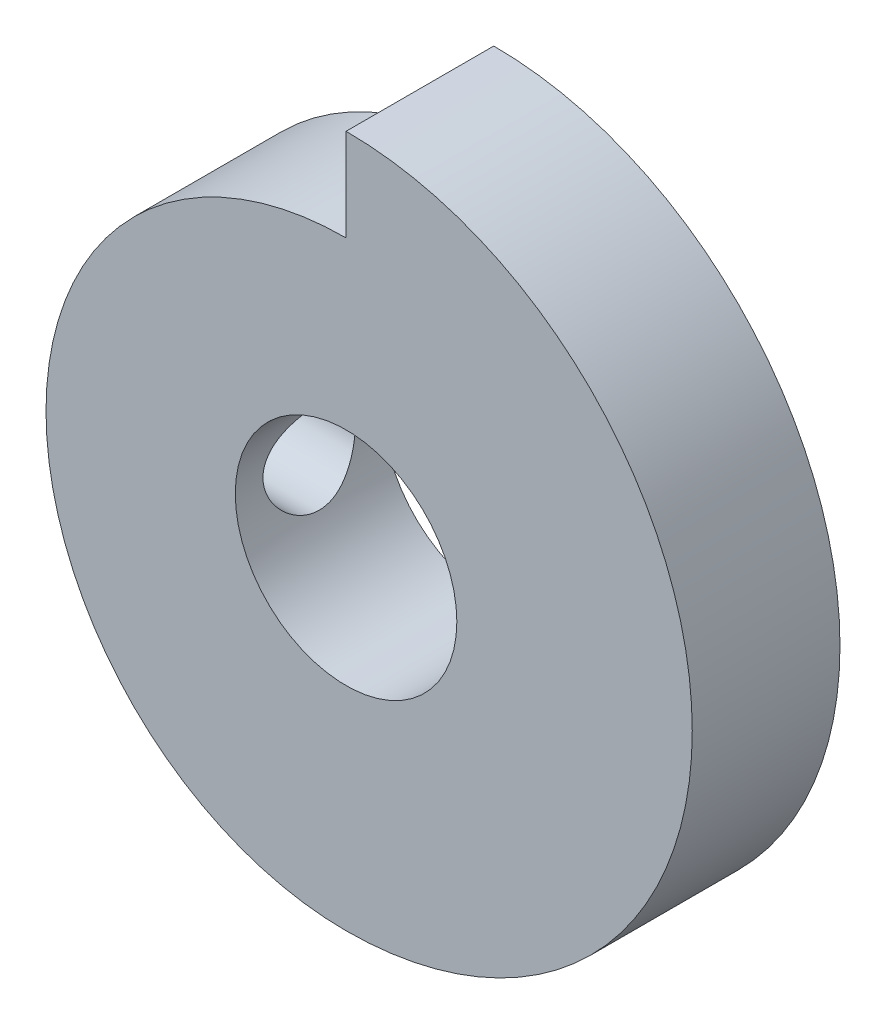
ISO-10303-21;
HEADER;
FILE_DESCRIPTION(('STEP AP214'),'2;1');
FILE_NAME('part.step','',(''),(''),'','','');
FILE_SCHEMA(('AUTOMOTIVE_DESIGN { 1 0 10303 214 1 1 1 1 }'));
ENDSEC;
DATA;
#1=APPLICATION_CONTEXT('core data for automotive mechanical design processes');
#2=APPLICATION_PROTOCOL_DEFINITION('international standard','automotive_design',2000,#1);
#3=PRODUCT_CONTEXT('',#1,'mechanical');
#4=PRODUCT('Part','Part','',(#3));
#5=PRODUCT_RELATED_PRODUCT_CATEGORY('part','',(#4));
#6=PRODUCT_DEFINITION_FORMATION('','',#4);
#7=PRODUCT_DEFINITION_CONTEXT('part definition',#1,'design');
#8=PRODUCT_DEFINITION('design','',#6,#7);
#9=PRODUCT_DEFINITION_SHAPE('','',#8);
#10=(LENGTH_UNIT() NAMED_UNIT(*) SI_UNIT(.MILLI.,.METRE.));
#11=(NAMED_UNIT(*) PLANE_ANGLE_UNIT() SI_UNIT($,.RADIAN.));
#12=(NAMED_UNIT(*) SI_UNIT($,.STERADIAN.) SOLID_ANGLE_UNIT());
#13=UNCERTAINTY_MEASURE_WITH_UNIT(LENGTH_MEASURE(1.E-05),#10,'distance_accuracy_value','');
#14=(GEOMETRIC_REPRESENTATION_CONTEXT(3) GLOBAL_UNCERTAINTY_ASSIGNED_CONTEXT((#13)) GLOBAL_UNIT_ASSIGNED_CONTEXT((#10,
#11,#12)) REPRESENTATION_CONTEXT('',''));
#15=CARTESIAN_POINT('',(0.,0.,0.));
#16=DIRECTION('',(0.,0.,1.));
#17=DIRECTION('',(1.,0.,0.));
#18=AXIS2_PLACEMENT_3D('',#15,#16,#17);
#19=CARTESIAN_POINT('',(0.,0.625,4.));
#20=DIRECTION('',(0.,0.,-1.));
#21=DIRECTION('',(-1.,0.,0.));
#22=AXIS2_PLACEMENT_3D('',#19,#20,#21);
#23=PLANE('',#22);
#24=CARTESIAN_POINT('',(0.,0.625,4.));
#25=DIRECTION('',(0.,0.,1.));
#26=DIRECTION('',(-1.,0.,0.));
#27=AXIS2_PLACEMENT_3D('',#24,#25,#26);
#28=CIRCLE('',#27,9.375);
#29=CARTESIAN_POINT('',(0.,-8.75,4.));
#30=VERTEX_POINT('',#29);
#31=CARTESIAN_POINT('',(0.,10.,4.));
#32=VERTEX_POINT('',#31);
#33=EDGE_CURVE('E81',#30,#32,#28,.T.);
#34=ORIENTED_EDGE('',*,*,#33,.T.);
#35=DIRECTION('',(0.,-1.,0.));
#36=VECTOR('',#35,1.);
#37=CARTESIAN_POINT('',(0.,10.,4.));
#38=LINE('',#37,#36);
#39=CARTESIAN_POINT('',(0.,7.5,4.));
#40=VERTEX_POINT('',#39);
#41=EDGE_CURVE('E75',#32,#40,#38,.T.);
#42=ORIENTED_EDGE('',*,*,#41,.T.);
#43=CARTESIAN_POINT('',(0.,-0.625000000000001,4.));
#44=DIRECTION('',(0.,0.,1.));
#45=DIRECTION('',(-1.,0.,0.));
#46=AXIS2_PLACEMENT_3D('',#43,#44,#45);
#47=CIRCLE('',#46,8.125);
#48=EDGE_CURVE('E54',#40,#30,#47,.T.);
#49=ORIENTED_EDGE('',*,*,#48,.T.);
#50=EDGE_LOOP('',(#34,#42,#49));
#51=FACE_BOUND('',#50,.T.);
#52=CARTESIAN_POINT('',(0.,0.,4.));
#53=DIRECTION('',(0.,0.,1.));
#54=DIRECTION('',(1.,0.,0.));
#55=AXIS2_PLACEMENT_3D('',#52,#53,#54);
#56=CIRCLE('',#55,3.);
#57=CARTESIAN_POINT('',(3.,0.,4.));
#58=VERTEX_POINT('',#57);
#59=EDGE_CURVE('E144',#58,#58,#56,.T.);
#60=ORIENTED_EDGE('',*,*,#59,.F.);
#61=EDGE_LOOP('',(#60));
#62=FACE_BOUND('',#61,.T.);
#63=ADVANCED_FACE('F32',(#51,#62),#23,.F.);
#64=CARTESIAN_POINT('',(0.,0.625,0.));
#65=DIRECTION('',(0.,0.,-1.));
#66=DIRECTION('',(-1.,0.,0.));
#67=AXIS2_PLACEMENT_3D('',#64,#65,#66);
#68=PLANE('',#67);
#69=CARTESIAN_POINT('',(0.,0.625,0.));
#70=DIRECTION('',(0.,0.,1.));
#71=DIRECTION('',(-1.,0.,0.));
#72=AXIS2_PLACEMENT_3D('',#69,#70,#71);
#73=CIRCLE('',#72,9.375);
#74=CARTESIAN_POINT('',(0.,-8.75,0.));
#75=VERTEX_POINT('',#74);
#76=CARTESIAN_POINT('',(0.,10.,0.));
#77=VERTEX_POINT('',#76);
#78=EDGE_CURVE('E89',#75,#77,#73,.T.);
#79=ORIENTED_EDGE('',*,*,#78,.F.);
#80=CARTESIAN_POINT('',(0.,-0.625000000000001,0.));
#81=DIRECTION('',(0.,0.,1.));
#82=DIRECTION('',(-1.,0.,0.));
#83=AXIS2_PLACEMENT_3D('',#80,#81,#82);
#84=CIRCLE('',#83,8.125);
#85=CARTESIAN_POINT('',(0.,7.5,0.));
#86=VERTEX_POINT('',#85);
#87=EDGE_CURVE('E72',#86,#75,#84,.T.);
#88=ORIENTED_EDGE('',*,*,#87,.F.);
#89=DIRECTION('',(0.,-1.,0.));
#90=VECTOR('',#89,1.);
#91=CARTESIAN_POINT('',(0.,10.,0.));
#92=LINE('',#91,#90);
#93=EDGE_CURVE('E67',#77,#86,#92,.T.);
#94=ORIENTED_EDGE('',*,*,#93,.F.);
#95=EDGE_LOOP('',(#79,#88,#94));
#96=FACE_BOUND('',#95,.T.);
#97=CARTESIAN_POINT('',(0.,0.,0.));
#98=DIRECTION('',(0.,0.,1.));
#99=DIRECTION('',(1.,0.,0.));
#100=AXIS2_PLACEMENT_3D('',#97,#98,#99);
#101=CIRCLE('',#100,3.);
#102=CARTESIAN_POINT('',(3.,0.,0.));
#103=VERTEX_POINT('',#102);
#104=EDGE_CURVE('E103',#103,#103,#101,.T.);
#105=ORIENTED_EDGE('',*,*,#104,.T.);
#106=EDGE_LOOP('',(#105));
#107=FACE_BOUND('',#106,.T.);
#108=ADVANCED_FACE('F155',(#96,#107),#68,.T.);
#109=CARTESIAN_POINT('',(0.,0.625,4.));
#110=DIRECTION('',(0.,0.,-1.));
#111=DIRECTION('',(-1.,0.,0.));
#112=AXIS2_PLACEMENT_3D('',#109,#110,#111);
#113=CYLINDRICAL_SURFACE('',#112,9.375);
#114=ORIENTED_EDGE('',*,*,#78,.T.);
#115=DIRECTION('',(0.,0.,-1.));
#116=VECTOR('',#115,1.);
#117=CARTESIAN_POINT('',(0.,10.,4.));
#118=LINE('',#117,#116);
#119=EDGE_CURVE('E78',#32,#77,#118,.T.);
#120=ORIENTED_EDGE('',*,*,#119,.F.);
#121=ORIENTED_EDGE('',*,*,#33,.F.);
#122=DIRECTION('',(0.,0.,-1.));
#123=VECTOR('',#122,1.);
#124=CARTESIAN_POINT('',(0.,-8.75,4.));
#125=LINE('',#124,#123);
#126=EDGE_CURVE('E92',#30,#75,#125,.T.);
#127=ORIENTED_EDGE('',*,*,#126,.T.);
#128=EDGE_LOOP('',(#114,#120,#121,#127));
#129=FACE_BOUND('',#128,.T.);
#130=ADVANCED_FACE('F87',(#129),#113,.T.);
#131=CARTESIAN_POINT('',(0.,10.,4.));
#132=DIRECTION('',(1.,0.,0.));
#133=DIRECTION('',(0.,0.,-1.));
#134=AXIS2_PLACEMENT_3D('',#131,#132,#133);
#135=PLANE('',#134);
#136=ORIENTED_EDGE('',*,*,#93,.T.);
#137=DIRECTION('',(0.,0.,-1.));
#138=VECTOR('',#137,1.);
#139=CARTESIAN_POINT('',(0.,7.5,4.));
#140=LINE('',#139,#138);
#141=EDGE_CURVE('E80',#40,#86,#140,.T.);
#142=ORIENTED_EDGE('',*,*,#141,.F.);
#143=ORIENTED_EDGE('',*,*,#41,.F.);
#144=ORIENTED_EDGE('',*,*,#119,.T.);
#145=EDGE_LOOP('',(#136,#142,#143,#144));
#146=FACE_BOUND('',#145,.T.);
#147=ADVANCED_FACE('F76',(#146),#135,.F.);
#148=CARTESIAN_POINT('',(0.,-0.625000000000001,4.));
#149=DIRECTION('',(0.,0.,-1.));
#150=DIRECTION('',(-1.,0.,0.));
#151=AXIS2_PLACEMENT_3D('',#148,#149,#150);
#152=CYLINDRICAL_SURFACE('',#151,8.125);
#153=CARTESIAN_POINT('',(-8.10092587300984,0.,0.631261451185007));
#154=CARTESIAN_POINT('',(-8.10184036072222,-0.0118527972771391,0.63136933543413));
#155=CARTESIAN_POINT('',(-8.10272868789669,-0.0237062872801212,0.63162489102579));
#156=CARTESIAN_POINT('',(-8.10445204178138,-0.0473988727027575,0.632431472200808));
#157=CARTESIAN_POINT('',(-8.10528710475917,-0.0592379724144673,0.632982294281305));
#158=CARTESIAN_POINT('',(-8.10690417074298,-0.0829017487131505,0.634379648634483));
#159=CARTESIAN_POINT('',(-8.10768617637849,-0.0947264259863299,0.635226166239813));
#160=CARTESIAN_POINT('',(-8.10919740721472,-0.118361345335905,0.637214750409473));
#161=CARTESIAN_POINT('',(-8.10992660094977,-0.130171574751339,0.63835699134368));
#162=CARTESIAN_POINT('',(-8.11133246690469,-0.153777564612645,0.640937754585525));
#163=CARTESIAN_POINT('',(-8.11200907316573,-0.16557328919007,0.64237664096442));
#164=CARTESIAN_POINT('',(-8.11331002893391,-0.189150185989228,0.645552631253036));
#165=CARTESIAN_POINT('',(-8.11393427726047,-0.200931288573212,0.647290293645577));
#166=CARTESIAN_POINT('',(-8.11513075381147,-0.224479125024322,0.65106599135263));
#167=CARTESIAN_POINT('',(-8.11570284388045,-0.236245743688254,0.653104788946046));
#168=CARTESIAN_POINT('',(-8.11679530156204,-0.259763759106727,0.657485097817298));
#169=CARTESIAN_POINT('',(-8.1173154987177,-0.27151498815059,0.659827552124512));
#170=CARTESIAN_POINT('',(-8.11830380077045,-0.294989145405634,0.664816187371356));
#171=CARTESIAN_POINT('',(-8.11877175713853,-0.306711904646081,0.667463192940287));
#172=CARTESIAN_POINT('',(-8.11965293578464,-0.330047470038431,0.673044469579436));
#173=CARTESIAN_POINT('',(-8.12006634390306,-0.341660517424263,0.675977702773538));
#174=CARTESIAN_POINT('',(-8.1208397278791,-0.364769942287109,0.682126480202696));
#175=CARTESIAN_POINT('',(-8.12119988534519,-0.376266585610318,0.685341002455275));
#176=CARTESIAN_POINT('',(-8.12186822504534,-0.399141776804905,0.692049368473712));
#177=CARTESIAN_POINT('',(-8.12217656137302,-0.410520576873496,0.69554233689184));
#178=CARTESIAN_POINT('',(-8.12274280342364,-0.433160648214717,0.702805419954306));
#179=CARTESIAN_POINT('',(-8.12300082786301,-0.444422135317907,0.706574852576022));
#180=CARTESIAN_POINT('',(-8.12346798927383,-0.466828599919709,0.714389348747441));
#181=CARTESIAN_POINT('',(-8.12367720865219,-0.477973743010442,0.718433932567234));
#182=CARTESIAN_POINT('',(-8.12404823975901,-0.500147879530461,0.726797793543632));
#183=CARTESIAN_POINT('',(-8.12421010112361,-0.511176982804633,0.731116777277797));
#184=CARTESIAN_POINT('',(-8.12448787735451,-0.533119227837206,0.740028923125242));
#185=CARTESIAN_POINT('',(-8.12460381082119,-0.544032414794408,0.744621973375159));
#186=CARTESIAN_POINT('',(-8.12479116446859,-0.565742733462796,0.754082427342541));
#187=CARTESIAN_POINT('',(-8.12486257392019,-0.576539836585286,0.758949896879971));
#188=CARTESIAN_POINT('',(-8.12496230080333,-0.598017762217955,0.768959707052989));
#189=CARTESIAN_POINT('',(-8.1249905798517,-0.608698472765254,0.774102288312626));
#190=CARTESIAN_POINT('',(-8.12500545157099,-0.629943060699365,0.784663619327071));
#191=CARTESIAN_POINT('',(-8.12499197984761,-0.640506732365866,0.790082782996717));
#192=CARTESIAN_POINT('',(-8.12492474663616,-0.661516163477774,0.801198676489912));
#193=CARTESIAN_POINT('',(-8.12487089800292,-0.671961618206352,0.806895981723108));
#194=CARTESIAN_POINT('',(-8.12472431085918,-0.692734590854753,0.818571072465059));
#195=CARTESIAN_POINT('',(-8.12463145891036,-0.703061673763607,0.824549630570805));
#196=CARTESIAN_POINT('',(-8.12440831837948,-0.723590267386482,0.836786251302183));
#197=CARTESIAN_POINT('',(-8.1242779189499,-0.733791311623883,0.843045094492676));
#198=CARTESIAN_POINT('',(-8.12398215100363,-0.754000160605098,0.855803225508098));
#199=CARTESIAN_POINT('',(-8.12381688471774,-0.764008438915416,0.862301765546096));
#200=CARTESIAN_POINT('',(-8.1234537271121,-0.783814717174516,0.875526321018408));
#201=CARTESIAN_POINT('',(-8.12325596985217,-0.793613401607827,0.882251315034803));
#202=CARTESIAN_POINT('',(-8.12283024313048,-0.81300474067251,0.895926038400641));
#203=CARTESIAN_POINT('',(-8.12260237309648,-0.822597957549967,0.902874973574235));
#204=CARTESIAN_POINT('',(-8.12211845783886,-0.841578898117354,0.91699649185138));
#205=CARTESIAN_POINT('',(-8.12186248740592,-0.850967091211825,0.924168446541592));
#206=CARTESIAN_POINT('',(-8.12132451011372,-0.869538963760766,0.938734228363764));
#207=CARTESIAN_POINT('',(-8.12104255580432,-0.878723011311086,0.94612758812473));
#208=CARTESIAN_POINT('',(-8.12045470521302,-0.896887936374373,0.961134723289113));
#209=CARTESIAN_POINT('',(-8.1201488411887,-0.905869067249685,0.968748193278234));
#210=CARTESIAN_POINT('',(-8.11951514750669,-0.923628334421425,0.984195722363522));
#211=CARTESIAN_POINT('',(-8.11918733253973,-0.932406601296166,0.992029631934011));
#212=CARTESIAN_POINT('',(-8.11851171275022,-0.949760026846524,1.00791821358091));
#213=CARTESIAN_POINT('',(-8.11816390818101,-0.958335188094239,1.01597288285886));
#214=CARTESIAN_POINT('',(-8.11745029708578,-0.975282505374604,1.03230295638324));
#215=CARTESIAN_POINT('',(-8.11708447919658,-0.983654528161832,1.0405784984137));
#216=CARTESIAN_POINT('',(-8.11633675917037,-1.00019493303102,1.05735112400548));
#217=CARTESIAN_POINT('',(-8.11595483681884,-1.00836303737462,1.06584848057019));
#218=CARTESIAN_POINT('',(-8.11517681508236,-1.02449425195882,1.08306630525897));
#219=CARTESIAN_POINT('',(-8.11478068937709,-1.03245692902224,1.09178717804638));
#220=CARTESIAN_POINT('',(-8.11397617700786,-1.04817571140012,1.10945346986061));
#221=CARTESIAN_POINT('',(-8.11356776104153,-1.05593122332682,1.11839941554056));
#222=CARTESIAN_POINT('',(-8.11274062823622,-1.07123244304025,1.13651677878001));
#223=CARTESIAN_POINT('',(-8.11232188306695,-1.07877741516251,1.14568881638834));
#224=CARTESIAN_POINT('',(-8.11147835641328,-1.09361384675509,1.16420913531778));
#225=CARTESIAN_POINT('',(-8.1110535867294,-1.10090572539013,1.17355708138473));
#226=CARTESIAN_POINT('',(-8.11020132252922,-1.11521493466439,1.19239991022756));
#227=CARTESIAN_POINT('',(-8.10977384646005,-1.1222332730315,1.20189402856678));
#228=CARTESIAN_POINT('',(-8.10891808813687,-1.13599889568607,1.22102846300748));
#229=CARTESIAN_POINT('',(-8.10848981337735,-1.14274700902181,1.23066818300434));
#230=CARTESIAN_POINT('',(-8.10763439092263,-1.15597404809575,1.25009210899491));
#231=CARTESIAN_POINT('',(-8.10720724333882,-1.16245365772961,1.25987584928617));
#232=CARTESIAN_POINT('',(-8.10635589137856,-1.17514600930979,1.2795872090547));
#233=CARTESIAN_POINT('',(-8.10593168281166,-1.18135926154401,1.28951449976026));
#234=CARTESIAN_POINT('',(-8.10508792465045,-1.19351940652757,1.30951276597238));
#235=CARTESIAN_POINT('',(-8.10466836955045,-1.19946664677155,1.31958352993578));
#236=CARTESIAN_POINT('',(-8.10383566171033,-1.21109540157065,1.33986825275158));
#237=CARTESIAN_POINT('',(-8.1034225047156,-1.21677709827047,1.3500821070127));
#238=CARTESIAN_POINT('',(-8.10260433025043,-1.22787550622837,1.3706525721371));
#239=CARTESIAN_POINT('',(-8.10219931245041,-1.23329222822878,1.38100917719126));
#240=CARTESIAN_POINT('',(-8.10139900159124,-1.24385982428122,1.4018657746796));
#241=CARTESIAN_POINT('',(-8.10100371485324,-1.24901052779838,1.41236585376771));
#242=CARTESIAN_POINT('',(-8.10022449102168,-1.25904538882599,1.43350993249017));
#243=CARTESIAN_POINT('',(-8.09984056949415,-1.2639291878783,1.44415410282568));
#244=CARTESIAN_POINT('',(-8.09908564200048,-1.273428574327,1.46558718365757));
#245=CARTESIAN_POINT('',(-8.09871466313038,-1.27804361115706,1.47637633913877));
#246=CARTESIAN_POINT('',(-8.09798715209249,-1.28700404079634,1.49810165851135));
#247=CARTESIAN_POINT('',(-8.09763066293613,-1.29134864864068,1.50903814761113));
#248=CARTESIAN_POINT('',(-8.09693375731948,-1.29976418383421,1.53105616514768));
#249=CARTESIAN_POINT('',(-8.09659339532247,-1.30383420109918,1.54213804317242));
#250=CARTESIAN_POINT('',(-8.09593177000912,-1.31167991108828,1.5643980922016));
#251=CARTESIAN_POINT('',(-8.09561049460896,-1.31545579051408,1.575576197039));
#252=CARTESIAN_POINT('',(-8.09498957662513,-1.32269772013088,1.59798139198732));
#253=CARTESIAN_POINT('',(-8.09468984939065,-1.3261649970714,1.60920808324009));
#254=CARTESIAN_POINT('',(-8.09411285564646,-1.33279454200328,1.63171309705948));
#255=CARTESIAN_POINT('',(-8.09383552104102,-1.33595774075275,1.64299114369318));
#256=CARTESIAN_POINT('',(-8.09330418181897,-1.34198098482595,1.66559742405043));
#257=CARTESIAN_POINT('',(-8.09305011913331,-1.34484178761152,1.67692545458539));
#258=CARTESIAN_POINT('',(-8.09256614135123,-1.3502624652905,1.69963129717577));
#259=CARTESIAN_POINT('',(-8.09233618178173,-1.35282289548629,1.71100897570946));
#260=CARTESIAN_POINT('',(-8.09190112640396,-1.35764389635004,1.73381395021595));
#261=CARTESIAN_POINT('',(-8.09169600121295,-1.35990482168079,1.74524117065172));
#262=CARTESIAN_POINT('',(-8.09131136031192,-1.36412816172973,1.76814535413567));
#263=CARTESIAN_POINT('',(-8.09113183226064,-1.36609072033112,1.77962229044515));
#264=CARTESIAN_POINT('',(-8.09079896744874,-1.36971682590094,1.80262569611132));
#265=CARTESIAN_POINT('',(-8.09064563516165,-1.3713803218,1.81415217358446));
#266=CARTESIAN_POINT('',(-8.09036574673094,-1.3744076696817,1.83725412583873));
#267=CARTESIAN_POINT('',(-8.0902392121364,-1.37577128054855,1.84882963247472));
#268=CARTESIAN_POINT('',(-8.09001351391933,-1.378198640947,1.87202949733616));
#269=CARTESIAN_POINT('',(-8.08991439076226,-1.37926194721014,1.88365390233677));
#270=CARTESIAN_POINT('',(-8.08974403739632,-1.38108677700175,1.90695441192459));
#271=CARTESIAN_POINT('',(-8.08967287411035,-1.38184757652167,1.91863057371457));
#272=CARTESIAN_POINT('',(-8.08955886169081,-1.38306525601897,1.94203196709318));
#273=CARTESIAN_POINT('',(-8.08951609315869,-1.38352127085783,1.95375724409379));
#274=CARTESIAN_POINT('',(-8.08945932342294,-1.38412641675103,1.97725922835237));
#275=CARTESIAN_POINT('',(-8.08944542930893,-1.38427440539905,1.98903596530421));
#276=CARTESIAN_POINT('',(-8.08944677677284,-1.3842600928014,2.0125959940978));
#277=CARTESIAN_POINT('',(-8.08946203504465,-1.3840976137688,2.02437928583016));
#278=CARTESIAN_POINT('',(-8.089521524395,-1.38346339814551,2.04789155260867));
#279=CARTESIAN_POINT('',(-8.08956564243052,-1.38299286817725,2.05962056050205));
#280=CARTESIAN_POINT('',(-8.08968238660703,-1.38174590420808,2.08302698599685));
#281=CARTESIAN_POINT('',(-8.08975492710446,-1.38097038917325,2.09470445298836));
#282=CARTESIAN_POINT('',(-8.08992798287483,-1.3791161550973,2.11800801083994));
#283=CARTESIAN_POINT('',(-8.09002843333,-1.37803813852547,2.12963415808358));
#284=CARTESIAN_POINT('',(-8.09025676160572,-1.37558121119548,2.15283517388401));
#285=CARTESIAN_POINT('',(-8.09038459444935,-1.37420279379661,2.1644100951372));
#286=CARTESIAN_POINT('',(-8.09066709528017,-1.37114666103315,2.18750892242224));
#287=CARTESIAN_POINT('',(-8.09082173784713,-1.36946922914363,2.19903286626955));
#288=CARTESIAN_POINT('',(-8.09115715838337,-1.36581528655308,2.2220297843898));
#289=CARTESIAN_POINT('',(-8.09133792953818,-1.36383885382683,2.23350277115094));
#290=CARTESIAN_POINT('',(-8.09172493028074,-1.35958743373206,2.25639785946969));
#291=CARTESIAN_POINT('',(-8.09193117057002,-1.3573123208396,2.26781993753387));
#292=CARTESIAN_POINT('',(-8.09236843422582,-1.35246397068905,2.29061332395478));
#293=CARTESIAN_POINT('',(-8.0925994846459,-1.3498904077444,2.30198456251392));
#294=CARTESIAN_POINT('',(-8.09308553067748,-1.34444372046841,2.32467605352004));
#295=CARTESIAN_POINT('',(-8.0933405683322,-1.34157006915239,2.33599617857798));
#296=CARTESIAN_POINT('',(-8.09387381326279,-1.33552158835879,2.35858604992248));
#297=CARTESIAN_POINT('',(-8.09415207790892,-1.33234601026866,2.36985559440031));
#298=CARTESIAN_POINT('',(-8.0947307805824,-1.32569245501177,2.39234177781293));
#299=CARTESIAN_POINT('',(-8.09503128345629,-1.32221358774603,2.40355815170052));
#300=CARTESIAN_POINT('',(-8.09565361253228,-1.31494991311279,2.4259396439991));
#301=CARTESIAN_POINT('',(-8.09597551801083,-1.31116395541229,2.4371043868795));
#302=CARTESIAN_POINT('',(-8.0966387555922,-1.30329307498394,2.45935305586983));
#303=CARTESIAN_POINT('',(-8.09698012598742,-1.29920755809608,2.47043677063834));
#304=CARTESIAN_POINT('',(-8.09767897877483,-1.29076126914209,2.4924568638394));
#305=CARTESIAN_POINT('',(-8.09803640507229,-1.28640143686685,2.50339360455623));
#306=CARTESIAN_POINT('',(-8.0987657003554,-1.277410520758,2.52511901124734));
#307=CARTESIAN_POINT('',(-8.09913752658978,-1.27278022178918,2.53590800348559));
#308=CARTESIAN_POINT('',(-8.0998940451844,-1.26325094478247,2.55733883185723));
#309=CARTESIAN_POINT('',(-8.10027870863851,-1.25835255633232,2.56798093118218));
#310=CARTESIAN_POINT('',(-8.1010592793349,-1.24828893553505,2.58911918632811));
#311=CARTESIAN_POINT('',(-8.10145516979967,-1.24312409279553,2.59961552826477));
#312=CARTESIAN_POINT('',(-8.10225657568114,-1.23252909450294,2.62046314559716));
#313=CARTESIAN_POINT('',(-8.10266208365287,-1.22709914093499,2.63081452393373));
#314=CARTESIAN_POINT('',(-8.10348105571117,-1.215974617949,2.65137265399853));
#315=CARTESIAN_POINT('',(-8.10389451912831,-1.21028007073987,2.6615794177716));
#316=CARTESIAN_POINT('',(-8.10472772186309,-1.19862681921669,2.68184863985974));
#317=CARTESIAN_POINT('',(-8.10514746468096,-1.19266796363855,2.69191101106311));
#318=CARTESIAN_POINT('',(-8.10599148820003,-1.18048576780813,2.71189135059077));
#319=CARTESIAN_POINT('',(-8.10641577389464,-1.17426210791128,2.72180912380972));
#320=CARTESIAN_POINT('',(-8.10726712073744,-1.16154966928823,2.74150002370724));
#321=CARTESIAN_POINT('',(-8.10769418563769,-1.15506040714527,2.75127283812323));
#322=CARTESIAN_POINT('',(-8.10854926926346,-1.14181526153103,2.77067334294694));
#323=CARTESIAN_POINT('',(-8.10897728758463,-1.13505872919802,2.78030059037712));
#324=CARTESIAN_POINT('',(-8.1098324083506,-1.12127715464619,2.79940917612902));
#325=CARTESIAN_POINT('',(-8.11025950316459,-1.11425130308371,2.8088899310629));
#326=CARTESIAN_POINT('',(-8.11111080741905,-1.09992930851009,2.82770379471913));
#327=CARTESIAN_POINT('',(-8.11153499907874,-1.09263221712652,2.83703618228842));
#328=CARTESIAN_POINT('',(-8.11237773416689,-1.07777794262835,2.85553538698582));
#329=CARTESIAN_POINT('',(-8.11279625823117,-1.07022008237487,2.86470166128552));
#330=CARTESIAN_POINT('',(-8.11362299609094,-1.05489008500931,2.88281050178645));
#331=CARTESIAN_POINT('',(-8.11403123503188,-1.04711859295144,2.89175361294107));
#332=CARTESIAN_POINT('',(-8.11483531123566,-1.03136749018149,2.90941449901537));
#333=CARTESIAN_POINT('',(-8.11523117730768,-1.02338845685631,2.91813278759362));
#334=CARTESIAN_POINT('',(-8.11600849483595,-1.00722568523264,2.93534356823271));
#335=CARTESIAN_POINT('',(-8.11638997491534,-0.999042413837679,2.94383649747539));
#336=CARTESIAN_POINT('',(-8.11713664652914,-0.982472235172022,2.9605987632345));
#337=CARTESIAN_POINT('',(-8.11750185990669,-0.974085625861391,2.96886839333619));
#338=CARTESIAN_POINT('',(-8.11821410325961,-0.957109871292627,2.98518564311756));
#339=CARTESIAN_POINT('',(-8.11856114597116,-0.948520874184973,2.9932334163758));
#340=CARTESIAN_POINT('',(-8.11923513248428,-0.931140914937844,3.00910766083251));
#341=CARTESIAN_POINT('',(-8.11956207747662,-0.922349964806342,3.01693414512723));
#342=CARTESIAN_POINT('',(-8.12019387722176,-0.904565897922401,3.03236566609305));
#343=CARTESIAN_POINT('',(-8.12049871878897,-0.895572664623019,3.03997056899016));
#344=CARTESIAN_POINT('',(-8.1210843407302,-0.877384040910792,3.05495901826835));
#345=CARTESIAN_POINT('',(-8.12136509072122,-0.868188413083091,3.06234227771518));
#346=CARTESIAN_POINT('',(-8.12190056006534,-0.849594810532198,3.07688738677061));
#347=CARTESIAN_POINT('',(-8.12215522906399,-0.840196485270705,3.08404879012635));
#348=CARTESIAN_POINT('',(-8.1226364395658,-0.821196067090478,3.09814871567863));
#349=CARTESIAN_POINT('',(-8.12286290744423,-0.811593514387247,3.10508662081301));
#350=CARTESIAN_POINT('',(-8.12328560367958,-0.792184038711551,3.11873786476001));
#351=CARTESIAN_POINT('',(-8.1234817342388,-0.782376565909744,3.12545042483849));
#352=CARTESIAN_POINT('',(-8.12384163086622,-0.762553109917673,3.13865051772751));
#353=CARTESIAN_POINT('',(-8.12400526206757,-0.752536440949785,3.14513702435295));
#354=CARTESIAN_POINT('',(-8.12429762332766,-0.732311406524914,3.15787044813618));
#355=CARTESIAN_POINT('',(-8.12442625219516,-0.722102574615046,3.16411662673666));
#356=CARTESIAN_POINT('',(-8.12464578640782,-0.701557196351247,3.17632865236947));
#357=CARTESIAN_POINT('',(-8.12473679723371,-0.691221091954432,3.18229524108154));
#358=CARTESIAN_POINT('',(-8.12487962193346,-0.670429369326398,3.19394693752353));
#359=CARTESIAN_POINT('',(-8.12493154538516,-0.65997416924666,3.19963279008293));
#360=CARTESIAN_POINT('',(-8.12499481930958,-0.638946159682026,3.2107249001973));
#361=CARTESIAN_POINT('',(-8.12500625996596,-0.628373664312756,3.21613175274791));
#362=CARTESIAN_POINT('',(-8.12498723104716,-0.607112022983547,3.22666855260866));
#363=CARTESIAN_POINT('',(-8.12495682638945,-0.596423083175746,3.23179891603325));
#364=CARTESIAN_POINT('',(-8.12485277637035,-0.574927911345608,3.24178439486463));
#365=CARTESIAN_POINT('',(-8.12477916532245,-0.564121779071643,3.24663972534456));
#366=CARTESIAN_POINT('',(-8.12458731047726,-0.542393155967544,3.25607550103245));
#367=CARTESIAN_POINT('',(-8.12446907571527,-0.531470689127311,3.26065600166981));
#368=CARTESIAN_POINT('',(-8.12418659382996,-0.509510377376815,3.26954281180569));
#369=CARTESIAN_POINT('',(-8.12402232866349,-0.498472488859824,3.27384901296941));
#370=CARTESIAN_POINT('',(-8.12364640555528,-0.476281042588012,3.28218714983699));
#371=CARTESIAN_POINT('',(-8.12343469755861,-0.465127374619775,3.28621878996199));
#372=CARTESIAN_POINT('',(-8.12296246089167,-0.442703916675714,3.2940071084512));
#373=CARTESIAN_POINT('',(-8.12270184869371,-0.431433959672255,3.29776330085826));
#374=CARTESIAN_POINT('',(-8.12213035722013,-0.40877742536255,3.30499959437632));
#375=CARTESIAN_POINT('',(-8.12181935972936,-0.397390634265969,3.30847901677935));
#376=CARTESIAN_POINT('',(-8.12114562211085,-0.37449982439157,3.31516000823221));
#377=CARTESIAN_POINT('',(-8.12078272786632,-0.362995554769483,3.31836070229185));
#378=CARTESIAN_POINT('',(-8.12000366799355,-0.339868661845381,3.32448193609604));
#379=CARTESIAN_POINT('',(-8.11958730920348,-0.328245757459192,3.32740138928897));
#380=CARTESIAN_POINT('',(-8.11870041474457,-0.304897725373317,3.3329531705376));
#381=CARTESIAN_POINT('',(-8.11822972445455,-0.293172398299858,3.33558463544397));
#382=CARTESIAN_POINT('',(-8.11723609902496,-0.269696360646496,3.34054172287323));
#383=CARTESIAN_POINT('',(-8.11671332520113,-0.257945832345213,3.3428682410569));
#384=CARTESIAN_POINT('',(-8.11561568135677,-0.23442962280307,3.34721668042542));
#385=CARTESIAN_POINT('',(-8.11504098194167,-0.22266410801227,3.34923954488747));
#386=CARTESIAN_POINT('',(-8.11383929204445,-0.199117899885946,3.35298370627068));
#387=CARTESIAN_POINT('',(-8.11321243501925,-0.187337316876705,3.35470573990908));
#388=CARTESIAN_POINT('',(-8.11190624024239,-0.163761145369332,3.35785089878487));
#389=CARTESIAN_POINT('',(-8.11122700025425,-0.151965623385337,3.35927456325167));
#390=CARTESIAN_POINT('',(-8.10981584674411,-0.128359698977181,3.36182462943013));
#391=CARTESIAN_POINT('',(-8.10908399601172,-0.116549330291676,3.36295137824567));
#392=CARTESIAN_POINT('',(-8.10756740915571,-0.0929136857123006,3.36490929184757));
#393=CARTESIAN_POINT('',(-8.10678270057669,-0.0810884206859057,3.36574060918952));
#394=CARTESIAN_POINT('',(-8.10516019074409,-0.0574229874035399,3.36710812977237));
#395=CARTESIAN_POINT('',(-8.10432238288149,-0.0455828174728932,3.36764429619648));
#396=CARTESIAN_POINT('',(-8.10259350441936,-0.0218880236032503,3.3684211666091));
#397=CARTESIAN_POINT('',(-8.10170239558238,-0.010033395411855,3.36866165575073));
#398=CARTESIAN_POINT('',(-8.09986676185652,0.0136898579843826,3.36884721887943));
#399=CARTESIAN_POINT('',(-8.09892216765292,0.0255584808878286,3.36879190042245));
#400=CARTESIAN_POINT('',(-8.09697916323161,0.0493113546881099,3.36838499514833));
#401=CARTESIAN_POINT('',(-8.09598064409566,0.0611955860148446,3.3680327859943));
#402=CARTESIAN_POINT('',(-8.09392972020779,0.0849784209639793,3.36703023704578));
#403=CARTESIAN_POINT('',(-8.09287718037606,0.0968769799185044,3.3663791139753));
#404=CARTESIAN_POINT('',(-8.09071786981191,0.120689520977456,3.36477656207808));
#405=CARTESIAN_POINT('',(-8.08961092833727,0.132603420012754,3.36382412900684));
#406=CARTESIAN_POINT('',(-8.08734389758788,0.156432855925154,3.36161731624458));
#407=CARTESIAN_POINT('',(-8.08618366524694,0.168348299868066,3.36036208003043));
#408=CARTESIAN_POINT('',(-8.08381696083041,0.192111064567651,3.3575556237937));
#409=CARTESIAN_POINT('',(-8.08261060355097,0.20395847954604,3.35600510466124));
#410=CARTESIAN_POINT('',(-8.08015342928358,0.227576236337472,3.35261141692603));
#411=CARTESIAN_POINT('',(-8.07890273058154,0.239346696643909,3.3507689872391));
#412=CARTESIAN_POINT('',(-8.07635761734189,0.262812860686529,3.34679372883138));
#413=CARTESIAN_POINT('',(-8.07506328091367,0.274508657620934,3.34466140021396));
#414=CARTESIAN_POINT('',(-8.07243186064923,0.297825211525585,3.3401078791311));
#415=CARTESIAN_POINT('',(-8.0710948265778,0.309446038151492,3.33768701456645));
#416=CARTESIAN_POINT('',(-8.06837891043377,0.332613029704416,3.3325576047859));
#417=CARTESIAN_POINT('',(-8.06700004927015,0.344159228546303,3.32984920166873));
#418=CARTESIAN_POINT('',(-8.06420138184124,0.367177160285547,3.32414506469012));
#419=CARTESIAN_POINT('',(-8.06278156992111,0.378648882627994,3.32114929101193));
#420=CARTESIAN_POINT('',(-8.05990190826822,0.401517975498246,3.3148703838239));
#421=CARTESIAN_POINT('',(-8.05844202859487,0.412915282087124,3.31158703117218));
#422=CARTESIAN_POINT('',(-8.05548313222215,0.435635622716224,3.30473216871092));
#423=CARTESIAN_POINT('',(-8.05398406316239,0.44695852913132,3.30116025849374));
#424=CARTESIAN_POINT('',(-8.05094771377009,0.469529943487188,3.2937270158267));
#425=CARTESIAN_POINT('',(-8.0494103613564,0.480778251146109,3.28986510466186));
#426=CARTESIAN_POINT('',(-8.04630054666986,0.503184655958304,3.28185553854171));
#427=CARTESIAN_POINT('',(-8.04472804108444,0.514342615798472,3.27770751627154));
#428=CARTESIAN_POINT('',(-8.0415579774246,0.536505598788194,3.26914849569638));
#429=CARTESIAN_POINT('',(-8.0399605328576,0.54751103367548,3.2647385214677));
#430=CARTESIAN_POINT('',(-8.03674309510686,0.569364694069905,3.25566094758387));
#431=CARTESIAN_POINT('',(-8.03512320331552,0.580213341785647,3.25099432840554));
#432=CARTESIAN_POINT('',(-8.03186252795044,0.601754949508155,3.24140601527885));
#433=CARTESIAN_POINT('',(-8.03022182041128,0.612448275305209,3.23648511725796));
#434=CARTESIAN_POINT('',(-8.02692115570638,0.633680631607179,3.22639043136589));
#435=CARTESIAN_POINT('',(-8.02526125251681,0.644219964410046,3.22121726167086));
#436=CARTESIAN_POINT('',(-8.02192383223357,0.665145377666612,3.21061935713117));
#437=CARTESIAN_POINT('',(-8.02024635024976,0.675531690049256,3.20519506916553));
#438=CARTESIAN_POINT('',(-8.01687540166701,0.69615208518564,3.1940962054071));
#439=CARTESIAN_POINT('',(-8.01518195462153,0.706386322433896,3.18842191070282));
#440=CARTESIAN_POINT('',(-8.01178071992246,0.726703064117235,3.17682338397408));
#441=CARTESIAN_POINT('',(-8.01007293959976,0.73678563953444,3.17089927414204));
#442=CARTESIAN_POINT('',(-8.00664475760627,0.756798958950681,3.15880060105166));
#443=CARTESIAN_POINT('',(-8.0049243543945,0.766729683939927,3.15262600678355));
#444=CARTESIAN_POINT('',(-8.00147262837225,0.786439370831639,3.14002613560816));
#445=CARTESIAN_POINT('',(-7.99974129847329,0.796218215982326,3.13360067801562));
#446=CARTESIAN_POINT('',(-7.9962693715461,0.815624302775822,3.12049834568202));
#447=CARTESIAN_POINT('',(-7.99452876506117,0.825251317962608,3.11382113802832));
#448=CARTESIAN_POINT('',(-7.99104013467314,0.84435259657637,3.10021340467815));
#449=CARTESIAN_POINT('',(-7.98929210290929,0.853826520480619,3.09328240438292));
#450=CARTESIAN_POINT('',(-7.98579014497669,0.872622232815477,3.07916400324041));
#451=CARTESIAN_POINT('',(-7.9840362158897,0.881943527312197,3.0719759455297));
#452=CARTESIAN_POINT('',(-7.98052542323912,0.900426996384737,3.05734511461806));
#453=CARTESIAN_POINT('',(-7.97876856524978,0.909588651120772,3.04990168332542));
#454=CARTESIAN_POINT('',(-7.97526327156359,0.927702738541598,3.03479792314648));
#455=CARTESIAN_POINT('',(-7.97351482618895,0.936655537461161,3.02713803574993));
#456=CARTESIAN_POINT('',(-7.97003310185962,0.954328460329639,3.01162298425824));
#457=CARTESIAN_POINT('',(-7.96829979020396,0.963049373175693,3.00376872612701));
#458=CARTESIAN_POINT('',(-7.96484975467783,0.98026326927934,2.98786509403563));
#459=CARTESIAN_POINT('',(-7.96313299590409,0.988756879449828,2.97981640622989));
#460=CARTESIAN_POINT('',(-7.95971812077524,1.00551691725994,2.96352560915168));
#461=CARTESIAN_POINT('',(-7.95801996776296,1.01378387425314,2.95528405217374));
#462=CARTESIAN_POINT('',(-7.95464415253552,1.03009244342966,2.93860881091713));
#463=CARTESIAN_POINT('',(-7.95296645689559,1.03813446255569,2.93017553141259));
#464=CARTESIAN_POINT('',(-7.94963351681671,1.05399349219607,2.9131167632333));
#465=CARTESIAN_POINT('',(-7.94797824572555,1.06181078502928,2.90449154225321));
#466=CARTESIAN_POINT('',(-7.94469212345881,1.07722070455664,2.88704886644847));
#467=CARTESIAN_POINT('',(-7.94306125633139,1.08481348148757,2.87823154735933));
#468=CARTESIAN_POINT('',(-7.93982588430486,1.09977494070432,2.86040481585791));
#469=CARTESIAN_POINT('',(-7.93822137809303,1.10714363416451,2.85139541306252));
#470=CARTESIAN_POINT('',(-7.93504075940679,1.12165635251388,2.8331836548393));
#471=CARTESIAN_POINT('',(-7.93346466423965,1.12880024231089,2.82398118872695));
#472=CARTESIAN_POINT('',(-7.93034293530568,1.14286252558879,2.80538182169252));
#473=CARTESIAN_POINT('',(-7.92879734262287,1.14978062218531,2.79598468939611));
#474=CARTESIAN_POINT('',(-7.92573876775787,1.16338996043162,2.77699449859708));
#475=CARTESIAN_POINT('',(-7.92422585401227,1.17008074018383,2.76740109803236));
#476=CARTESIAN_POINT('',(-7.92123509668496,1.18323257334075,2.74801823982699));
#477=CARTESIAN_POINT('',(-7.91975734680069,1.1896930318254,2.73822836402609));
#478=CARTESIAN_POINT('',(-7.91683927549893,1.20238158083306,2.7184504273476));
#479=CARTESIAN_POINT('',(-7.91539908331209,1.20860889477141,2.70846184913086));
#480=CARTESIAN_POINT('',(-7.91256662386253,1.22079345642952,2.68834161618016));
#481=CARTESIAN_POINT('',(-7.91117426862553,1.22675120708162,2.67821027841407));
#482=CARTESIAN_POINT('',(-7.90844289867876,1.23838172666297,2.65783270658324));
#483=CARTESIAN_POINT('',(-7.90710369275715,1.24405554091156,2.6475870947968));
#484=CARTESIAN_POINT('',(-7.90447981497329,1.25512131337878,2.62698055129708));
#485=CARTESIAN_POINT('',(-7.90319498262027,1.26051411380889,2.61662009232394));
#486=CARTESIAN_POINT('',(-7.90068121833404,1.27101965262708,2.59578458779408));
#487=CARTESIAN_POINT('',(-7.89945215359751,1.27613306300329,2.58530989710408));
#488=CARTESIAN_POINT('',(-7.89705131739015,1.28608127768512,2.56424642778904));
#489=CARTESIAN_POINT('',(-7.89587944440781,1.29091657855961,2.55365789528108));
#490=CARTESIAN_POINT('',(-7.89359443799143,1.30030915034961,2.53236684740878));
#491=CARTESIAN_POINT('',(-7.89248123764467,1.30486673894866,2.52166447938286));
#492=CARTESIAN_POINT('',(-7.8903150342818,1.31370429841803,2.50014579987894));
#493=CARTESIAN_POINT('',(-7.88926200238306,1.31798440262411,2.48932954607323));
#494=CARTESIAN_POINT('',(-7.88721767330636,1.32626643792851,2.46758273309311));
#495=CARTESIAN_POINT('',(-7.88622638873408,1.33026831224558,2.45665215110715));
#496=CARTESIAN_POINT('',(-7.88430710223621,1.33799321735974,2.43467626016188));
#497=CARTESIAN_POINT('',(-7.8833791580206,1.34171599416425,2.42363085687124));
#498=CARTESIAN_POINT('',(-7.8815881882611,1.34888105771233,2.40142450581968));
#499=CARTESIAN_POINT('',(-7.88072526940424,1.35232288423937,2.39026340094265));
#500=CARTESIAN_POINT('',(-7.87906605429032,1.35892407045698,2.367824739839));
#501=CARTESIAN_POINT('',(-7.87826991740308,1.36208275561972,2.35654697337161));
#502=CARTESIAN_POINT('',(-7.87674592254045,1.36811528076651,2.33387346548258));
#503=CARTESIAN_POINT('',(-7.87601828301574,1.37098821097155,2.32247746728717));
#504=CARTESIAN_POINT('',(-7.87463395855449,1.37644271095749,2.29957847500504));
#505=CARTESIAN_POINT('',(-7.87397747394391,1.379023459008,2.28807527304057));
#506=CARTESIAN_POINT('',(-7.87274130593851,1.38387420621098,2.2650391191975));
#507=CARTESIAN_POINT('',(-7.87216137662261,1.38614520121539,2.25350639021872));
#508=CARTESIAN_POINT('',(-7.87107913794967,1.39037664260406,2.23042380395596));
#509=CARTESIAN_POINT('',(-7.870576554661,1.39233818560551,2.21887416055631));
#510=CARTESIAN_POINT('',(-7.86964898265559,1.39595361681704,2.19575790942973));
#511=CARTESIAN_POINT('',(-7.86922377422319,1.39760837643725,2.18419144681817));
#512=CARTESIAN_POINT('',(-7.86845111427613,1.40061212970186,2.16104301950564));
#513=CARTESIAN_POINT('',(-7.86810348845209,1.40196180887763,2.14946114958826));
#514=CARTESIAN_POINT('',(-7.86748602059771,1.40435711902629,2.12628139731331));
#515=CARTESIAN_POINT('',(-7.8672160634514,1.40540319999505,2.11468356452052));
#516=CARTESIAN_POINT('',(-7.86675402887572,1.40719284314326,2.0914719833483));
#517=CARTESIAN_POINT('',(-7.86656189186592,1.40793663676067,2.07985825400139));
#518=CARTESIAN_POINT('',(-7.86625571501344,1.40912134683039,2.05661485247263));
#519=CARTESIAN_POINT('',(-7.86614167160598,1.40956227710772,2.04498518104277));
#520=CARTESIAN_POINT('',(-7.86599189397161,1.41014102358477,2.02170989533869));
#521=CARTESIAN_POINT('',(-7.86595621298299,1.41027863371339,2.01006427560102));
#522=CARTESIAN_POINT('',(-7.86596335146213,1.41025076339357,1.98675705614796));
#523=CARTESIAN_POINT('',(-7.86600628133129,1.41008485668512,1.97509545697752));
#524=CARTESIAN_POINT('',(-7.86617095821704,1.40944823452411,1.95175616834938));
#525=CARTESIAN_POINT('',(-7.86629287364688,1.40897686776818,1.94007849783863));
#526=CARTESIAN_POINT('',(-7.86661583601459,1.40772743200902,1.9167074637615));
#527=CARTESIAN_POINT('',(-7.8668171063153,1.40694849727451,1.90501414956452));
#528=CARTESIAN_POINT('',(-7.86729918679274,1.40508117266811,1.88161104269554));
#529=CARTESIAN_POINT('',(-7.86758028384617,1.40399166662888,1.86990134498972));
#530=CARTESIAN_POINT('',(-7.86822198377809,1.40150179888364,1.84648205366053));
#531=CARTESIAN_POINT('',(-7.86858282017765,1.40010052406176,1.83477256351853));
#532=CARTESIAN_POINT('',(-7.86938138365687,1.3969951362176,1.8114331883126));
#533=CARTESIAN_POINT('',(-7.86981887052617,1.39529196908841,1.79980316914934));
#534=CARTESIAN_POINT('',(-7.8707688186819,1.3915879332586,1.77663512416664));
#535=CARTESIAN_POINT('',(-7.87128101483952,1.38958811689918,1.76509691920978));
#536=CARTESIAN_POINT('',(-7.87237885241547,1.38529380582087,1.74211034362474));
#537=CARTESIAN_POINT('',(-7.87296429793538,1.3830000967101,1.73066181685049));
#538=CARTESIAN_POINT('',(-7.87420710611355,1.37812104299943,1.70785378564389));
#539=CARTESIAN_POINT('',(-7.87486433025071,1.37553625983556,1.69649415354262));
#540=CARTESIAN_POINT('',(-7.87624929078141,1.37007690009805,1.67386312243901));
#541=CARTESIAN_POINT('',(-7.87697694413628,1.36720266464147,1.66259163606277));
#542=CARTESIAN_POINT('',(-7.87850143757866,1.36116529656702,1.64013658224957));
#543=CARTESIAN_POINT('',(-7.87929824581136,1.35800229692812,1.62895297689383));
#544=CARTESIAN_POINT('',(-7.88095969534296,1.3513886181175,1.60667328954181));
#545=CARTESIAN_POINT('',(-7.881824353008,1.34793786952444,1.59557722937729));
#546=CARTESIAN_POINT('',(-7.88362019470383,1.3407495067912,1.57347228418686));
#547=CARTESIAN_POINT('',(-7.88455144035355,1.33701162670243,1.56246349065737));
#548=CARTESIAN_POINT('',(-7.88647928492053,1.32924811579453,1.54053322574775));
#549=CARTESIAN_POINT('',(-7.887475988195,1.32522202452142,1.52961192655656));
#550=CARTESIAN_POINT('',(-7.88953354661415,1.31688153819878,1.50785666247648));
#551=CARTESIAN_POINT('',(-7.89059454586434,1.31256649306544,1.49702296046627));
#552=CARTESIAN_POINT('',(-7.89277957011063,1.3036464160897,1.4754432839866));
#553=CARTESIAN_POINT('',(-7.89390377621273,1.29904054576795,1.4646976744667));
#554=CARTESIAN_POINT('',(-7.89621416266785,1.2895367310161,1.44329403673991));
#555=CARTESIAN_POINT('',(-7.89740056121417,1.28463774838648,1.43263649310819));
#556=CARTESIAN_POINT('',(-7.89983380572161,1.27454679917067,1.41141380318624));
#557=CARTESIAN_POINT('',(-7.90108087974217,1.26935371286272,1.40084921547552));
#558=CARTESIAN_POINT('',(-7.90362660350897,1.25870418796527,1.37987709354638));
#559=CARTESIAN_POINT('',(-7.90492518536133,1.25324809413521,1.3694693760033));
#560=CARTESIAN_POINT('',(-7.90756844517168,1.24208841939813,1.34883678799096));
#561=CARTESIAN_POINT('',(-7.90891296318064,1.23638568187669,1.33861144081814));
#562=CARTESIAN_POINT('',(-7.91164581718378,1.22473543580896,1.31834053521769));
#563=CARTESIAN_POINT('',(-7.9130340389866,1.21878855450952,1.30829460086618));
#564=CARTESIAN_POINT('',(-7.91585204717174,1.20665230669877,1.28838099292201));
#565=CARTESIAN_POINT('',(-7.91728175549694,1.20046338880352,1.27851303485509));
#566=CARTESIAN_POINT('',(-7.92018056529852,1.18784492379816,1.25895375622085));
#567=CARTESIAN_POINT('',(-7.92164962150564,1.18141565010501,1.24926225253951));
#568=CARTESIAN_POINT('',(-7.92462503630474,1.16831764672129,1.23005473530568));
#569=CARTESIAN_POINT('',(-7.92613137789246,1.1616490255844,1.22053864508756));
#570=CARTESIAN_POINT('',(-7.9291793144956,1.14807342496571,1.20168084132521));
#571=CARTESIAN_POINT('',(-7.93072091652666,1.14116639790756,1.19233916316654));
#572=CARTESIAN_POINT('',(-7.93383745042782,1.12711361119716,1.17383014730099));
#573=CARTESIAN_POINT('',(-7.93541240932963,1.11996765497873,1.1646629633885));
#574=CARTESIAN_POINT('',(-7.9385937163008,1.10543680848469,1.14650278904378));
#575=CARTESIAN_POINT('',(-7.94020010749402,1.09805157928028,1.13751007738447));
#576=CARTESIAN_POINT('',(-7.94344236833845,1.0830419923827,1.11969836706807));
#577=CARTESIAN_POINT('',(-7.94507829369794,1.07541715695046,1.11087978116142));
#578=CARTESIAN_POINT('',(-7.94837786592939,1.0599266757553,1.09341664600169));
#579=CARTESIAN_POINT('',(-7.95004157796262,1.05206041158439,1.08477265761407));
#580=CARTESIAN_POINT('',(-7.95339477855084,1.03608550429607,1.06766069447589));
#581=CARTESIAN_POINT('',(-7.95508433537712,1.02797612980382,1.05919341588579));
#582=CARTESIAN_POINT('',(-7.95848727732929,1.01151361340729,1.04243686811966));
#583=CARTESIAN_POINT('',(-7.96020073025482,1.00315963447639,1.03414843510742));
#584=CARTESIAN_POINT('',(-7.96364534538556,0.986227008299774,1.01777098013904));
#585=CARTESIAN_POINT('',(-7.96537653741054,0.977647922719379,1.00968241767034));
#586=CARTESIAN_POINT('',(-7.96884451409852,0.960314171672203,0.993752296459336));
#587=CARTESIAN_POINT('',(-7.97058126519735,0.951560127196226,0.985910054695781));
#588=CARTESIAN_POINT('',(-7.97405807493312,0.933879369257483,0.970471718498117));
#589=CARTESIAN_POINT('',(-7.97579811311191,0.924953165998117,0.96287503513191));
#590=CARTESIAN_POINT('',(-7.97927962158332,0.906928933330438,0.947924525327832));
#591=CARTESIAN_POINT('',(-7.98102108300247,0.89783125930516,0.940570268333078));
#592=CARTESIAN_POINT('',(-7.98450349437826,0.879465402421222,0.926101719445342));
#593=CARTESIAN_POINT('',(-7.9862444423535,0.870197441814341,0.918987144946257));
#594=CARTESIAN_POINT('',(-7.98972394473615,0.851491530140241,0.904997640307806));
#595=CARTESIAN_POINT('',(-7.99146249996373,0.842053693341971,0.898122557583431));
#596=CARTESIAN_POINT('',(-7.99493539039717,0.823008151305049,0.884611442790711));
#597=CARTESIAN_POINT('',(-7.99666972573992,0.813400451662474,0.877975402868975));
#598=CARTESIAN_POINT('',(-8.00013235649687,0.79401537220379,0.864941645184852));
#599=CARTESIAN_POINT('',(-8.00186064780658,0.784237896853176,0.858544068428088));
#600=CARTESIAN_POINT('',(-8.00530946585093,0.764512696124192,0.845986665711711));
#601=CARTESIAN_POINT('',(-8.00702998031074,0.754564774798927,0.839827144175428));
#602=CARTESIAN_POINT('',(-8.01046150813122,0.734497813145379,0.827747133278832));
#603=CARTESIAN_POINT('',(-8.01217249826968,0.724378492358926,0.821827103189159));
#604=CARTESIAN_POINT('',(-8.01558312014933,0.703968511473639,0.810227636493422));
#605=CARTESIAN_POINT('',(-8.01728271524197,0.693677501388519,0.804548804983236));
#606=CARTESIAN_POINT('',(-8.02066879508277,0.672923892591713,0.793432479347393));
#607=CARTESIAN_POINT('',(-8.02235522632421,0.662460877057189,0.787995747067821));
#608=CARTESIAN_POINT('',(-8.02571362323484,0.641357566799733,0.7773656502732));
#609=CARTESIAN_POINT('',(-8.02738550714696,0.630716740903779,0.772173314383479));
#610=CARTESIAN_POINT('',(-8.03071064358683,0.609272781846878,0.762041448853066));
#611=CARTESIAN_POINT('',(-8.03236382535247,0.598469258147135,0.757102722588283));
#612=CARTESIAN_POINT('',(-8.03563944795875,0.57676696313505,0.747511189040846));
#613=CARTESIAN_POINT('',(-8.03726195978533,0.565868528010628,0.742857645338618));
#614=CARTESIAN_POINT('',(-8.04047389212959,0.543985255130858,0.733837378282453));
#615=CARTESIAN_POINT('',(-8.04206339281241,0.533000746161,0.729469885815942));
#616=CARTESIAN_POINT('',(-8.04520820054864,0.510946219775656,0.721019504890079));
#617=CARTESIAN_POINT('',(-8.04676357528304,0.499876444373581,0.716936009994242));
#618=CARTESIAN_POINT('',(-8.04983910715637,0.477651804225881,0.709051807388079));
#619=CARTESIAN_POINT('',(-8.05135931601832,0.466497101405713,0.705250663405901));
#620=CARTESIAN_POINT('',(-8.05436351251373,0.444102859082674,0.697929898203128));
#621=CARTESIAN_POINT('',(-8.05584753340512,0.432863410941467,0.694410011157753));
#622=CARTESIAN_POINT('',(-8.05877836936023,0.410299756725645,0.687651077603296));
#623=CARTESIAN_POINT('',(-8.06022519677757,0.398975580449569,0.68441193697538));
#624=CARTESIAN_POINT('',(-8.0630806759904,0.37624237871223,0.678214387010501));
#625=CARTESIAN_POINT('',(-8.06448931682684,0.364833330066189,0.675256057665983));
#626=CARTESIAN_POINT('',(-8.06726746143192,0.341930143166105,0.669620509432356));
#627=CARTESIAN_POINT('',(-8.06863692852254,0.330435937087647,0.666943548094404));
#628=CARTESIAN_POINT('',(-8.07133577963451,0.307362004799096,0.661871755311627));
#629=CARTESIAN_POINT('',(-8.07266509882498,0.295782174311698,0.659477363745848));
#630=CARTESIAN_POINT('',(-8.07528275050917,0.272535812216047,0.654972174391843));
#631=CARTESIAN_POINT('',(-8.07657098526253,0.260869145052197,0.652862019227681));
#632=CARTESIAN_POINT('',(-8.07910543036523,0.237449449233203,0.648927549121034));
#633=CARTESIAN_POINT('',(-8.08035151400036,0.225696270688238,0.647104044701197));
#634=CARTESIAN_POINT('',(-8.08280062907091,0.202103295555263,0.643745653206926));
#635=CARTESIAN_POINT('',(-8.08400350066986,0.190263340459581,0.642211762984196));
#636=CARTESIAN_POINT('',(-8.08636400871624,0.166508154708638,0.639437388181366));
#637=CARTESIAN_POINT('',(-8.08752149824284,0.154592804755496,0.638197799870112));
#638=CARTESIAN_POINT('',(-8.08978281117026,0.130765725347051,0.636022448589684));
#639=CARTESIAN_POINT('',(-8.09088678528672,0.118854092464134,0.635085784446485));
#640=CARTESIAN_POINT('',(-8.0930403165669,0.0950453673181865,0.633514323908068));
#641=CARTESIAN_POINT('',(-8.09409003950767,0.0831483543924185,0.632878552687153));
#642=CARTESIAN_POINT('',(-8.09613526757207,0.0593689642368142,0.631906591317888));
#643=CARTESIAN_POINT('',(-8.09713090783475,0.0474866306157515,0.631569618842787));
#644=CARTESIAN_POINT('',(-8.09906832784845,0.0237364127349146,0.631193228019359));
#645=CARTESIAN_POINT('',(-8.10001020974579,0.0118685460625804,0.631153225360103));
#646=CARTESIAN_POINT('',(-8.10092587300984,0.,0.631261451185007));
#647=B_SPLINE_CURVE_WITH_KNOTS('',3,(#153,#154,#155,#156,#157,#158,#159,#160,#161,#162,#163,
#164,#165,#166,#167,#168,#169,#170,#171,#172,#173,#174,#175,#176,#177,#178,#179,#180,#181,#182,
#183,#184,#185,#186,#187,#188,#189,#190,#191,#192,#193,#194,#195,#196,#197,#198,#199,#200,#201,
#202,#203,#204,#205,#206,#207,#208,#209,#210,#211,#212,#213,#214,#215,#216,#217,#218,#219,#220,
#221,#222,#223,#224,#225,#226,#227,#228,#229,#230,#231,#232,#233,#234,#235,#236,#237,#238,#239,
#240,#241,#242,#243,#244,#245,#246,#247,#248,#249,#250,#251,#252,#253,#254,#255,#256,#257,#258,
#259,#260,#261,#262,#263,#264,#265,#266,#267,#268,#269,#270,#271,#272,#273,#274,#275,#276,#277,
#278,#279,#280,#281,#282,#283,#284,#285,#286,#287,#288,#289,#290,#291,#292,#293,#294,#295,#296,
#297,#298,#299,#300,#301,#302,#303,#304,#305,#306,#307,#308,#309,#310,#311,#312,#313,#314,#315,
#316,#317,#318,#319,#320,#321,#322,#323,#324,#325,#326,#327,#328,#329,#330,#331,#332,#333,#334,
#335,#336,#337,#338,#339,#340,#341,#342,#343,#344,#345,#346,#347,#348,#349,#350,#351,#352,#353,
#354,#355,#356,#357,#358,#359,#360,#361,#362,#363,#364,#365,#366,#367,#368,#369,#370,#371,#372,
#373,#374,#375,#376,#377,#378,#379,#380,#381,#382,#383,#384,#385,#386,#387,#388,#389,#390,#391,
#392,#393,#394,#395,#396,#397,#398,#399,#400,#401,#402,#403,#404,#405,#406,#407,#408,#409,#410,
#411,#412,#413,#414,#415,#416,#417,#418,#419,#420,#421,#422,#423,#424,#425,#426,#427,#428,#429,
#430,#431,#432,#433,#434,#435,#436,#437,#438,#439,#440,#441,#442,#443,#444,#445,#446,#447,#448,
#449,#450,#451,#452,#453,#454,#455,#456,#457,#458,#459,#460,#461,#462,#463,#464,#465,#466,#467,
#468,#469,#470,#471,#472,#473,#474,#475,#476,#477,#478,#479,#480,#481,#482,#483,#484,#485,#486,
#487,#488,#489,#490,#491,#492,#493,#494,#495,#496,#497,#498,#499,#500,#501,#502,#503,#504,#505,
#506,#507,#508,#509,#510,#511,#512,#513,#514,#515,#516,#517,#518,#519,#520,#521,#522,#523,#524,
#525,#526,#527,#528,#529,#530,#531,#532,#533,#534,#535,#536,#537,#538,#539,#540,#541,#542,#543,
#544,#545,#546,#547,#548,#549,#550,#551,#552,#553,#554,#555,#556,#557,#558,#559,#560,#561,#562,
#563,#564,#565,#566,#567,#568,#569,#570,#571,#572,#573,#574,#575,#576,#577,#578,#579,#580,#581,
#582,#583,#584,#585,#586,#587,#588,#589,#590,#591,#592,#593,#594,#595,#596,#597,#598,#599,#600,
#601,#602,#603,#604,#605,#606,#607,#608,#609,#610,#611,#612,#613,#614,#615,#616,#617,#618,#619,
#620,#621,#622,#623,#624,#625,#626,#627,#628,#629,#630,#631,#632,#633,#634,#635,#636,#637,#638,
#639,#640,#641,#642,#643,#644,#645,#646),.UNSPECIFIED.,.F.,.F.,(4,2,2,2,2,2,2,2,2,2,2,2,2,2,2,2,
2,2,2,2,2,2,2,2,2,2,2,2,2,2,2,2,2,2,2,2,2,2,2,2,2,2,2,2,2,2,2,2,2,2,2,2,2,2,2,2,2,2,2,2,2,2,2,2,
2,2,2,2,2,2,2,2,2,2,2,2,2,2,2,2,2,2,2,2,2,2,2,2,2,2,2,2,2,2,2,2,2,2,2,2,2,2,2,2,2,2,2,2,2,2,2,2,
2,2,2,2,2,2,2,2,2,2,2,2,2,2,2,2,2,2,2,2,2,2,2,2,2,2,2,2,2,2,2,2,2,2,2,2,2,2,2,2,2,2,2,2,2,2,2,2,
2,2,2,2,2,2,2,2,2,2,2,2,2,2,2,2,2,2,2,2,2,2,2,2,2,2,2,2,2,2,2,2,2,2,2,2,2,2,2,2,2,2,2,2,2,2,2,2,
2,2,2,2,2,2,2,2,2,2,2,2,2,2,2,2,2,2,2,2,2,2,2,2,2,2,2,2,2,2,2,2,2,2,2,2,2,2,4),(0.,
0.0356646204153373,0.0713046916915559,0.106942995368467,0.142602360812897,0.178305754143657,
0.214076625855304,0.249939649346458,0.285916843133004,0.321993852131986,0.357944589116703,
0.393769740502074,0.429486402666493,0.465117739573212,0.50068847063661,0.536221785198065,
0.571740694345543,0.607268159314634,0.642827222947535,0.678441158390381,0.714132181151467,
0.749927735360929,0.785830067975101,0.821628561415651,0.857282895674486,0.892822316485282,
0.928269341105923,0.963646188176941,0.998976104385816,1.03428260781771,1.06958866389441,
1.10491728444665,1.14029165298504,1.17573535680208,1.21127156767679,1.24691941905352,
1.28250510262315,1.31794411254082,1.35326443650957,1.38848844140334,1.42364163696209,
1.45874748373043,1.49382888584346,1.52890886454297,1.5640110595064,1.59915929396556,
1.63437716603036,1.66969290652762,1.70512046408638,1.74052534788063,1.77578253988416,
1.81092812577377,1.84598347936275,1.88097296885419,1.91592064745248,1.95085141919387,
1.98578815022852,2.02075286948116,2.05576893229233,2.09086830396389,2.12606688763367,
2.16139578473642,2.19674491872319,2.23195641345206,2.2670626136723,2.30208795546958,
2.33705620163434,2.37199147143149,2.40691764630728,2.44185854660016,2.47683794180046,
2.51187983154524,2.54701099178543,2.5822489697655,2.61762565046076,2.65307450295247,
2.68840790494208,2.72364342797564,2.75880435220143,2.79391524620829,2.82899979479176,
2.86408140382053,2.89918335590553,2.93432895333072,2.96954164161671,3.00484580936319,
3.04026598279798,3.0758244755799,3.1114835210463,3.14704469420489,3.18251573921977,
3.21791202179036,3.25325924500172,3.28858135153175,3.3239013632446,3.35924227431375,
3.39462711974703,3.43007904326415,3.46562166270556,3.5012765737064,3.5370764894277,
3.57297882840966,3.60877980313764,3.64448003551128,3.6801006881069,3.715666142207,
3.75120338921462,3.7867334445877,3.82227744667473,3.8578591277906,3.89350214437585,
3.92923003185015,3.96506631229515,4.00103591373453,4.03711052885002,4.07307669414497,
4.10892871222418,4.14469166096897,4.18038940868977,4.21604523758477,4.2516826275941,
4.28732446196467,4.32299217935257,4.35870722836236,4.39449732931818,4.43038175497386,
4.46638706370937,4.50249543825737,4.53851914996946,4.57445309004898,4.61032580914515,
4.64615814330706,4.68197285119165,4.71779252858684,4.75363974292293,4.78953758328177,
4.82550906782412,4.86152762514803,4.89741361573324,4.93317092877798,4.96882239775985,
5.00439051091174,5.03989759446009,5.07536572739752,5.11081670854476,5.14627209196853,
5.18175350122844,5.21728360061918,5.25288392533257,5.2885828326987,5.32438190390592,
5.36011258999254,5.39570003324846,5.43117630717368,5.46656109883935,5.5018770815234,
5.53714656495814,5.57239188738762,5.60763544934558,5.64289980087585,5.67820879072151,
5.71358568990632,5.74904817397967,5.78461983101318,5.82012212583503,5.85548230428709,
5.89072956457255,5.92588793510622,5.96098144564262,5.99603402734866,6.03106963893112,
6.06611237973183,6.10118663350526,6.13631723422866,6.17152941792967,6.20685034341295,
6.24226825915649,6.27756947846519,6.31274264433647,6.34781431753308,6.38280638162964,
6.41774631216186,6.45265944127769,6.48757097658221,6.52250622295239,6.55749057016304,
6.59254975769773,6.62770834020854,6.66299490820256,6.69838621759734,6.73366853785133,
6.76882856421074,6.8038964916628,6.83889790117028,6.87385853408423,6.90880314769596,
6.94375621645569,6.9787420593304,7.0137851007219,7.04890981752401,7.08414088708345,
7.11950512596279,7.15501447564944,7.19047848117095,7.22582956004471,7.26109489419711,
7.29629770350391,7.33146161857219,7.36660978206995,7.40176500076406,7.4369498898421,
7.47218700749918,7.50749950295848,7.54291157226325,7.57844370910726,7.61411633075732,
7.64986449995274,7.68550274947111,7.72104799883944,7.75652628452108,7.79196115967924,
7.82737302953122,7.86278373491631,7.89821505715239,7.93369028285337,7.96923059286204,
8.00485534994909,8.04058526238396,8.07645412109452,8.11243036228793,8.1483094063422,
8.18408764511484,8.21978697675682,8.25542994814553,8.29103882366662,8.32663571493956,
8.36224271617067,8.39788203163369,8.43357611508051,8.46934959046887,8.50522246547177,
8.54121664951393,8.57731908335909,8.61331310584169,8.64918970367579,8.68497208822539,
8.72068404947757),.UNSPECIFIED.);
#648=CARTESIAN_POINT('',(-8.10092587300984,0.,0.631261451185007));
#649=VERTEX_POINT('',#648);
#650=EDGE_CURVE('E46',#649,#649,#647,.F.);
#651=ORIENTED_EDGE('',*,*,#650,.T.);
#652=EDGE_LOOP('',(#651));
#653=FACE_BOUND('',#652,.T.);
#654=ORIENTED_EDGE('',*,*,#87,.T.);
#655=ORIENTED_EDGE('',*,*,#126,.F.);
#656=ORIENTED_EDGE('',*,*,#48,.F.);
#657=ORIENTED_EDGE('',*,*,#141,.T.);
#658=EDGE_LOOP('',(#654,#655,#656,#657));
#659=FACE_BOUND('',#658,.T.);
#660=ADVANCED_FACE('F140',(#653,#659),#152,.T.);
#661=CARTESIAN_POINT('',(0.,0.,4.));
#662=DIRECTION('',(0.,0.,-1.));
#663=DIRECTION('',(-1.,0.,0.));
#664=AXIS2_PLACEMENT_3D('',#661,#662,#663);
#665=CYLINDRICAL_SURFACE('',#664,3.);
#666=CARTESIAN_POINT('',(-3.,0.,3.25));
#667=CARTESIAN_POINT('',(-2.99999458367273,-0.0669580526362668,3.2499927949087));
#668=CARTESIAN_POINT('',(-2.9977323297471,-0.134021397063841,3.24458804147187));
#669=CARTESIAN_POINT('',(-2.98890153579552,-0.266247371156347,3.22316093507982));
#670=CARTESIAN_POINT('',(-2.98232175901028,-0.331404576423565,3.20711087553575));
#671=CARTESIAN_POINT('',(-2.96556289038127,-0.457688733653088,3.16508890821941));
#672=CARTESIAN_POINT('',(-2.95539599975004,-0.518828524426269,3.13915061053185));
#673=CARTESIAN_POINT('',(-2.93245286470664,-0.635829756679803,3.07822717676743));
#674=CARTESIAN_POINT('',(-2.91967741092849,-0.69169279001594,3.04324478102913));
#675=CARTESIAN_POINT('',(-2.89207828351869,-0.799448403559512,2.96337101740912));
#676=CARTESIAN_POINT('',(-2.87718753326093,-0.851041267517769,2.91809869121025));
#677=CARTESIAN_POINT('',(-2.84732714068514,-0.946159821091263,2.81973566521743));
#678=CARTESIAN_POINT('',(-2.83235746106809,-0.989681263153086,2.76664087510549));
#679=CARTESIAN_POINT('',(-2.80321021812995,-1.06953737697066,2.65097322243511));
#680=CARTESIAN_POINT('',(-2.78910786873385,-1.10541308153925,2.58806255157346));
#681=CARTESIAN_POINT('',(-2.76435572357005,-1.16593940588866,2.45642674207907));
#682=CARTESIAN_POINT('',(-2.75370415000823,-1.19059580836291,2.38770462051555));
#683=CARTESIAN_POINT('',(-2.73778555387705,-1.22674598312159,2.24984630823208));
#684=CARTESIAN_POINT('',(-2.73228387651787,-1.23881657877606,2.18088951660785));
#685=CARTESIAN_POINT('',(-2.72661326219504,-1.25125209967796,2.04172670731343));
#686=CARTESIAN_POINT('',(-2.7264413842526,-1.25162348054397,1.97152139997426));
#687=CARTESIAN_POINT('',(-2.73125119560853,-1.24108450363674,1.83759993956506));
#688=CARTESIAN_POINT('',(-2.73583882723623,-1.23103681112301,1.77379890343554));
#689=CARTESIAN_POINT('',(-2.74898482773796,-1.20139191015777,1.64888790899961));
#690=CARTESIAN_POINT('',(-2.75754395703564,-1.18179287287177,1.58777846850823));
#691=CARTESIAN_POINT('',(-2.77786184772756,-1.13321958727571,1.46844229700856));
#692=CARTESIAN_POINT('',(-2.78968481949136,-1.10405471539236,1.41030457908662));
#693=CARTESIAN_POINT('',(-2.81518331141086,-1.03731242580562,1.29952226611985));
#694=CARTESIAN_POINT('',(-2.82885956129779,-0.999731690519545,1.24687984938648));
#695=CARTESIAN_POINT('',(-2.85792976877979,-0.913495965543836,1.14390004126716));
#696=CARTESIAN_POINT('',(-2.87337121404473,-0.864173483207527,1.09413343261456));
#697=CARTESIAN_POINT('',(-2.90325673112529,-0.757729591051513,1.00338649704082));
#698=CARTESIAN_POINT('',(-2.9177005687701,-0.700606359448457,0.962408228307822));
#699=CARTESIAN_POINT('',(-2.94438283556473,-0.578447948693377,0.889564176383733));
#700=CARTESIAN_POINT('',(-2.95656266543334,-0.513260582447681,0.857930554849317));
#701=CARTESIAN_POINT('',(-2.97689481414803,-0.377852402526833,0.80627886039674));
#702=CARTESIAN_POINT('',(-2.985049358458,-0.307634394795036,0.786254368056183));
#703=CARTESIAN_POINT('',(-2.99599641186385,-0.168928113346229,0.759584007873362));
#704=CARTESIAN_POINT('',(-2.99909541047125,-0.10061128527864,0.75217214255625));
#705=CARTESIAN_POINT('',(-3.00056050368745,0.0363546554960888,0.748653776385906));
#706=CARTESIAN_POINT('',(-2.99892795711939,0.105003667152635,0.752544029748));
#707=CARTESIAN_POINT('',(-2.9913121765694,0.237098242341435,0.770971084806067));
#708=CARTESIAN_POINT('',(-2.9855488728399,0.300632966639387,0.784969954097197));
#709=CARTESIAN_POINT('',(-2.97048606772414,0.424382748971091,0.822468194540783));
#710=CARTESIAN_POINT('',(-2.96118611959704,0.484597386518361,0.845968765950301));
#711=CARTESIAN_POINT('',(-2.93958270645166,0.602108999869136,0.902570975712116));
#712=CARTESIAN_POINT('',(-2.92719491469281,0.659257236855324,0.935948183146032));
#713=CARTESIAN_POINT('',(-2.9007380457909,0.767346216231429,1.01105337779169));
#714=CARTESIAN_POINT('',(-2.88666826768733,0.818284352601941,1.05278485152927));
#715=CARTESIAN_POINT('',(-2.85712087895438,0.916333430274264,1.14690323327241));
#716=CARTESIAN_POINT('',(-2.84161451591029,0.962910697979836,1.19983850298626));
#717=CARTESIAN_POINT('',(-2.81184336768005,1.04666984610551,1.31302127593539));
#718=CARTESIAN_POINT('',(-2.79757886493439,1.08384959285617,1.37327043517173));
#719=CARTESIAN_POINT('',(-2.77181386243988,1.14815960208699,1.50061417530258));
#720=CARTESIAN_POINT('',(-2.76035562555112,1.17513918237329,1.56779403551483));
#721=CARTESIAN_POINT('',(-2.74208355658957,1.21717413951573,1.70637059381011));
#722=CARTESIAN_POINT('',(-2.73526589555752,1.23223934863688,1.77776376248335));
#723=CARTESIAN_POINT('',(-2.72763164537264,1.24904080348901,1.91681869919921));
#724=CARTESIAN_POINT('',(-2.72639350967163,1.25171380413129,1.98434466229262));
#725=CARTESIAN_POINT('',(-2.72893853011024,1.24615575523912,2.1188428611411));
#726=CARTESIAN_POINT('',(-2.73272091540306,1.23792637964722,2.18581518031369));
#727=CARTESIAN_POINT('',(-2.74449551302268,1.21158404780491,2.31409274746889));
#728=CARTESIAN_POINT('',(-2.7522835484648,1.19394903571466,2.37551667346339));
#729=CARTESIAN_POINT('',(-2.77103181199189,1.14976328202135,2.49454802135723));
#730=CARTESIAN_POINT('',(-2.78199293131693,1.12321003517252,2.55215436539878));
#731=CARTESIAN_POINT('',(-2.80666954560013,1.0601028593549,2.66569589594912));
#732=CARTESIAN_POINT('',(-2.82051102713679,1.02304360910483,2.72132233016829));
#733=CARTESIAN_POINT('',(-2.84903689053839,0.940684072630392,2.82586013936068));
#734=CARTESIAN_POINT('',(-2.86372156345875,0.89538092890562,2.87476917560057));
#735=CARTESIAN_POINT('',(-2.89356392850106,0.793902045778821,2.96814868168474));
#736=CARTESIAN_POINT('',(-2.90867817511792,0.737174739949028,3.01203643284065));
#737=CARTESIAN_POINT('',(-2.9366014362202,0.616600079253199,3.08969945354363));
#738=CARTESIAN_POINT('',(-2.9494093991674,0.552749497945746,3.12347011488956));
#739=CARTESIAN_POINT('',(-2.97109183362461,0.42073205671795,3.17920984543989));
#740=CARTESIAN_POINT('',(-2.98002782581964,0.352653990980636,3.2013647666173));
#741=CARTESIAN_POINT('',(-2.99321009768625,0.213410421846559,3.23370632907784));
#742=CARTESIAN_POINT('',(-2.99747105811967,0.142255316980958,3.24393044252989));
#743=CARTESIAN_POINT('',(-2.99972287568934,0.0472360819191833,3.24933316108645));
#744=CARTESIAN_POINT('',(-3.00000191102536,0.0236245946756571,3.25000254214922));
#745=CARTESIAN_POINT('',(-3.,0.,3.25));
#746=B_SPLINE_CURVE_WITH_KNOTS('',3,(#666,#667,#668,#669,#670,#671,#672,#673,#674,#675,#676,
#677,#678,#679,#680,#681,#682,#683,#684,#685,#686,#687,#688,#689,#690,#691,#692,#693,#694,#695,
#696,#697,#698,#699,#700,#701,#702,#703,#704,#705,#706,#707,#708,#709,#710,#711,#712,#713,#714,
#715,#716,#717,#718,#719,#720,#721,#722,#723,#724,#725,#726,#727,#728,#729,#730,#731,#732,#733,
#734,#735,#736,#737,#738,#739,#740,#741,#742,#743,#744,#745),.UNSPECIFIED.,.T.,.F.,(4,2,2,2,2,2,
2,2,2,2,2,2,2,2,2,2,2,2,2,2,2,2,2,2,2,2,2,2,2,2,2,2,2,2,2,2,2,2,2,4),(0.,0.200806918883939,
0.402138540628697,0.602791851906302,0.803384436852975,1.01317936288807,1.22308438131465,
1.44331724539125,1.66343646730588,1.87295273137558,2.08235338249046,2.27570157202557,
2.46908679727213,2.66658713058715,2.86416545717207,3.07844141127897,3.29276749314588,
3.51204055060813,3.73119224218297,3.93648443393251,4.14171767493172,4.33676589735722,
4.53183876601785,4.73297135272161,4.93418805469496,5.14978488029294,5.36543061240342,
5.58414788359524,5.80268447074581,6.00439877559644,6.20608211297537,6.39837649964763,
6.59072494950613,6.79463893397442,6.99862373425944,7.2174653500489,7.43640649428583,
7.65172855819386,7.86637250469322,7.93722256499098),.UNSPECIFIED.);
#747=CARTESIAN_POINT('',(-3.,0.,3.25));
#748=VERTEX_POINT('',#747);
#749=EDGE_CURVE('E96',#748,#748,#746,.T.);
#750=ORIENTED_EDGE('',*,*,#749,.F.);
#751=EDGE_LOOP('',(#750));
#752=FACE_BOUND('',#751,.T.);
#753=ORIENTED_EDGE('',*,*,#59,.T.);
#754=EDGE_LOOP('',(#753));
#755=FACE_BOUND('',#754,.T.);
#756=ORIENTED_EDGE('',*,*,#104,.F.);
#757=EDGE_LOOP('',(#756));
#758=FACE_BOUND('',#757,.T.);
#759=ADVANCED_FACE('F105',(#752,#755,#758),#665,.F.);
#760=CARTESIAN_POINT('',(-10.,0.,2.));
#761=DIRECTION('',(1.,0.,0.));
#762=DIRECTION('',(0.,0.,-1.));
#763=AXIS2_PLACEMENT_3D('',#760,#761,#762);
#764=CYLINDRICAL_SURFACE('',#763,1.25);
#765=CARTESIAN_POINT('',(-7.93587313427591,-0.0116289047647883,0.75005409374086));
#766=CARTESIAN_POINT('',(-7.93415049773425,0.00876116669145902,0.749864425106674));
#767=CARTESIAN_POINT('',(-7.93233106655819,0.029175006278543,0.750173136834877));
#768=CARTESIAN_POINT('',(-7.92849683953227,0.0700506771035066,0.751796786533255));
#769=CARTESIAN_POINT('',(-7.92648188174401,0.0905134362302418,0.753112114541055));
#770=CARTESIAN_POINT('',(-7.9233120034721,0.121241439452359,0.755851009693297));
#771=CARTESIAN_POINT('',(-7.92222926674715,0.131503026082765,0.756893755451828));
#772=CARTESIAN_POINT('',(-7.92002173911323,0.151969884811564,0.759229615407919));
#773=CARTESIAN_POINT('',(-7.91889809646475,0.162165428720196,0.760521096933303));
#774=CARTESIAN_POINT('',(-7.91546968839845,0.192629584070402,0.764761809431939));
#775=CARTESIAN_POINT('',(-7.91310440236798,0.212806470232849,0.76807917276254));
#776=CARTESIAN_POINT('',(-7.90822529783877,0.252861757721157,0.77567305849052));
#777=CARTESIAN_POINT('',(-7.90571080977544,0.272746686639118,0.779950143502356));
#778=CARTESIAN_POINT('',(-7.90053876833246,0.312234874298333,0.789453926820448));
#779=CARTESIAN_POINT('',(-7.89788121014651,0.331838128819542,0.794680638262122));
#780=CARTESIAN_POINT('',(-7.89242987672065,0.370764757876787,0.806080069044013));
#781=CARTESIAN_POINT('',(-7.88963609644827,0.390088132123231,0.81225278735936));
#782=CARTESIAN_POINT('',(-7.88391930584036,0.428454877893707,0.825547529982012));
#783=CARTESIAN_POINT('',(-7.88099628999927,0.447498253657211,0.832669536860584));
#784=CARTESIAN_POINT('',(-7.87652025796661,0.47585176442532,0.844072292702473));
#785=CARTESIAN_POINT('',(-7.87501299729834,0.485267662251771,0.847993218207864));
#786=CARTESIAN_POINT('',(-7.8719689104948,0.504028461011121,0.856077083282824));
#787=CARTESIAN_POINT('',(-7.87043240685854,0.51337139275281,0.860239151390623));
#788=CARTESIAN_POINT('',(-7.86732949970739,0.531993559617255,0.868811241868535));
#789=CARTESIAN_POINT('',(-7.8657648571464,0.541261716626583,0.873216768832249));
#790=CARTESIAN_POINT('',(-7.86262573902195,0.559623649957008,0.882222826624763));
#791=CARTESIAN_POINT('',(-7.8610480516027,0.568737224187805,0.886831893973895));
#792=CARTESIAN_POINT('',(-7.85313149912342,0.613912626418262,0.910382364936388));
#793=CARTESIAN_POINT('',(-7.84669196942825,0.648915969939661,0.930867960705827));
#794=CARTESIAN_POINT('',(-7.83370363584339,0.716661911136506,0.975045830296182));
#795=CARTESIAN_POINT('',(-7.82715342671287,0.749413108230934,0.998740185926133));
#796=CARTESIAN_POINT('',(-7.8140421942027,0.812670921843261,1.04936496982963));
#797=CARTESIAN_POINT('',(-7.8074822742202,0.843171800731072,1.07628901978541));
#798=CARTESIAN_POINT('',(-7.79445661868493,0.901884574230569,1.13352153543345));
#799=CARTESIAN_POINT('',(-7.7880989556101,0.92961296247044,1.16336125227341));
#800=CARTESIAN_POINT('',(-7.7758027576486,0.981889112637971,1.22537842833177));
#801=CARTESIAN_POINT('',(-7.76986251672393,1.0064434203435,1.25756291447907));
#802=CARTESIAN_POINT('',(-7.76134402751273,1.04091266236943,1.30760487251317));
#803=CARTESIAN_POINT('',(-7.75856986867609,1.05200806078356,1.3245802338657));
#804=CARTESIAN_POINT('',(-7.75316658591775,1.07340346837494,1.35912730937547));
#805=CARTESIAN_POINT('',(-7.75053744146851,1.08370352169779,1.3766989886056));
#806=CARTESIAN_POINT('',(-7.74543935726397,1.10349559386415,1.41245005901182));
#807=CARTESIAN_POINT('',(-7.74297082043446,1.11298607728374,1.43062624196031));
#808=CARTESIAN_POINT('',(-7.73820859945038,1.13114594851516,1.46761541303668));
#809=CARTESIAN_POINT('',(-7.73593560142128,1.13973664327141,1.48626903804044));
#810=CARTESIAN_POINT('',(-7.73161571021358,1.15594845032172,1.52386735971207));
#811=CARTESIAN_POINT('',(-7.72956833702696,1.16357137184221,1.5428158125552));
#812=CARTESIAN_POINT('',(-7.72570634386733,1.17786303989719,1.58100789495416));
#813=CARTESIAN_POINT('',(-7.7238917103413,1.18453177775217,1.60025160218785));
#814=CARTESIAN_POINT('',(-7.71880900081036,1.20311416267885,1.65842433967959));
#815=CARTESIAN_POINT('',(-7.71590172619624,1.21360730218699,1.69779429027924));
#816=CARTESIAN_POINT('',(-7.71231650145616,1.22647033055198,1.75774359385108));
#817=CARTESIAN_POINT('',(-7.7112507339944,1.23027791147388,1.77787686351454));
#818=CARTESIAN_POINT('',(-7.70938806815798,1.23691575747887,1.81844579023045));
#819=CARTESIAN_POINT('',(-7.70859078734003,1.23974740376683,1.83889306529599));
#820=CARTESIAN_POINT('',(-7.70727737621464,1.24440456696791,1.8800571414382));
#821=CARTESIAN_POINT('',(-7.70676669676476,1.24621083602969,1.9005955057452));
#822=CARTESIAN_POINT('',(-7.70603251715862,1.24880584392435,1.94163324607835));
#823=CARTESIAN_POINT('',(-7.70580927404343,1.24959363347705,1.96212474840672));
#824=CARTESIAN_POINT('',(-7.70556697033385,1.25044895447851,2.02351826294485));
#825=CARTESIAN_POINT('',(-7.70597510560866,1.24901160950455,2.06433944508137));
#826=CARTESIAN_POINT('',(-7.7074307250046,1.24386072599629,2.12541043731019));
#827=CARTESIAN_POINT('',(-7.70805656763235,1.24164379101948,2.145740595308));
#828=CARTESIAN_POINT('',(-7.70958851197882,1.23620163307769,2.18634682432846));
#829=CARTESIAN_POINT('',(-7.71049503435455,1.23297493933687,2.20662920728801));
#830=CARTESIAN_POINT('',(-7.71206338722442,1.22737151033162,2.23699270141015));
#831=CARTESIAN_POINT('',(-7.7126215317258,1.22537427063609,2.24711237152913));
#832=CARTESIAN_POINT('',(-7.7138075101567,1.22112191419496,2.2673353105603));
#833=CARTESIAN_POINT('',(-7.71443554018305,1.21886606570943,2.27743897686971));
#834=CARTESIAN_POINT('',(-7.71641288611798,1.21174769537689,2.30755870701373));
#835=CARTESIAN_POINT('',(-7.71785786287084,1.20652589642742,2.3274370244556));
#836=CARTESIAN_POINT('',(-7.72098920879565,1.1951471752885,2.36680101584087));
#837=CARTESIAN_POINT('',(-7.72267547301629,1.18899063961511,2.38628645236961));
#838=CARTESIAN_POINT('',(-7.72627734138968,1.17575562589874,2.42487019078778));
#839=CARTESIAN_POINT('',(-7.72819295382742,1.16867713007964,2.44396848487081));
#840=CARTESIAN_POINT('',(-7.73224247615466,1.15360359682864,2.48178106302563));
#841=CARTESIAN_POINT('',(-7.73437639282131,1.1456085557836,2.50049534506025));
#842=CARTESIAN_POINT('',(-7.73885212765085,1.12870057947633,2.53754027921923));
#843=CARTESIAN_POINT('',(-7.7411939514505,1.11978765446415,2.55587093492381));
#844=CARTESIAN_POINT('',(-7.74607564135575,1.10103574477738,2.59214623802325));
#845=CARTESIAN_POINT('',(-7.74861543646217,1.09119700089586,2.61008988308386));
#846=CARTESIAN_POINT('',(-7.75256682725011,1.0757322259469,2.63671494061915));
#847=CARTESIAN_POINT('',(-7.75390927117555,1.07045262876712,2.64555150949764));
#848=CARTESIAN_POINT('',(-7.75662822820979,1.05970278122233,2.66305000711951));
#849=CARTESIAN_POINT('',(-7.75800527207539,1.0542305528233,2.67171636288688));
#850=CARTESIAN_POINT('',(-7.76218304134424,1.03753670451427,2.69744889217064));
#851=CARTESIAN_POINT('',(-7.76503473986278,1.02602110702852,2.71427872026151));
#852=CARTESIAN_POINT('',(-7.77085100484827,1.00224764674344,2.74727041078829));
#853=CARTESIAN_POINT('',(-7.77381635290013,0.989986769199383,2.76343739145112));
#854=CARTESIAN_POINT('',(-7.78286192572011,0.952092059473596,2.8109642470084));
#855=CARTESIAN_POINT('',(-7.78909156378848,0.925348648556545,2.84135218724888));
#856=CARTESIAN_POINT('',(-7.79865264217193,0.883003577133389,2.88499460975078));
#857=CARTESIAN_POINT('',(-7.80187586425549,0.868516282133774,2.89921829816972));
#858=CARTESIAN_POINT('',(-7.80838161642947,0.838786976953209,2.92701158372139));
#859=CARTESIAN_POINT('',(-7.81166265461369,0.823552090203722,2.94057520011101));
#860=CARTESIAN_POINT('',(-7.81827725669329,0.792283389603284,2.96706095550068));
#861=CARTESIAN_POINT('',(-7.82158557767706,0.776367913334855,2.97988127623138));
#862=CARTESIAN_POINT('',(-7.82817703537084,0.744050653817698,3.00464067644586));
#863=CARTESIAN_POINT('',(-7.83146281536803,0.727636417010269,3.0165902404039));
#864=CARTESIAN_POINT('',(-7.84126990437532,0.67764322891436,3.05116208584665));
#865=CARTESIAN_POINT('',(-7.84774196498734,0.643310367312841,3.07251449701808));
#866=CARTESIAN_POINT('',(-7.85728025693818,0.590308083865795,3.10201867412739));
#867=CARTESIAN_POINT('',(-7.86043148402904,0.572389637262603,3.11143201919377));
#868=CARTESIAN_POINT('',(-7.86666622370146,0.536045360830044,3.12940975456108));
#869=CARTESIAN_POINT('',(-7.86974974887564,0.517619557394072,3.13797418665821));
#870=CARTESIAN_POINT('',(-7.87583793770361,0.480251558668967,3.15424160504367));
#871=CARTESIAN_POINT('',(-7.8788421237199,0.461312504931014,3.16194343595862));
#872=CARTESIAN_POINT('',(-7.88476238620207,0.422892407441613,3.17647091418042));
#873=CARTESIAN_POINT('',(-7.88765688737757,0.403550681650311,3.18324345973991));
#874=CARTESIAN_POINT('',(-7.89330483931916,0.364627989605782,3.19581129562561));
#875=CARTESIAN_POINT('',(-7.89605886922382,0.345043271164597,3.20160798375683));
#876=CARTESIAN_POINT('',(-7.90142072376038,0.305628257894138,3.21223264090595));
#877=CARTESIAN_POINT('',(-7.9040285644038,0.285797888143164,3.2170606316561));
#878=CARTESIAN_POINT('',(-7.90909197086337,0.245890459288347,3.22574666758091));
#879=CARTESIAN_POINT('',(-7.91154754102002,0.22581340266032,3.22960472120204));
#880=CARTESIAN_POINT('',(-7.91630037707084,0.185409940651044,3.23634243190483));
#881=CARTESIAN_POINT('',(-7.91859687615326,0.165090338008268,3.23922113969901));
#882=CARTESIAN_POINT('',(-7.92192067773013,0.134400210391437,3.24279639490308));
#883=CARTESIAN_POINT('',(-7.92300804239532,0.124137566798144,3.24386327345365));
#884=CARTESIAN_POINT('',(-7.92513059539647,0.103650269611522,3.24573763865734));
#885=CARTESIAN_POINT('',(-7.92616782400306,0.0934070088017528,3.24654742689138));
#886=CARTESIAN_POINT('',(-7.92920403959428,0.0627120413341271,3.24859416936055));
#887=CARTESIAN_POINT('',(-7.93113084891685,0.0422648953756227,3.24945227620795));
#888=CARTESIAN_POINT('',(-7.93661693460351,-0.0189816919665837,3.25052253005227));
#889=CARTESIAN_POINT('',(-7.93988587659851,-0.059723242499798,3.2492380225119));
#890=CARTESIAN_POINT('',(-7.94421497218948,-0.1206839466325,3.24432749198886));
#891=CARTESIAN_POINT('',(-7.94556237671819,-0.140979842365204,3.24219264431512));
#892=CARTESIAN_POINT('',(-7.94806753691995,-0.181522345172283,3.23691855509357));
#893=CARTESIAN_POINT('',(-7.94922529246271,-0.201768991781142,3.23377935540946));
#894=CARTESIAN_POINT('',(-7.9513527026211,-0.242211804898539,3.22648100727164));
#895=CARTESIAN_POINT('',(-7.95232248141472,-0.26241080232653,3.22232123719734));
#896=CARTESIAN_POINT('',(-7.95407498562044,-0.302745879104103,3.21296066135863));
#897=CARTESIAN_POINT('',(-7.95485029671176,-0.322709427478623,3.20780016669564));
#898=CARTESIAN_POINT('',(-7.95621083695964,-0.362251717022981,3.19653513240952));
#899=CARTESIAN_POINT('',(-7.95679595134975,-0.381827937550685,3.19043114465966));
#900=CARTESIAN_POINT('',(-7.95778643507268,-0.420595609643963,3.17729275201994));
#901=CARTESIAN_POINT('',(-7.9581917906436,-0.439787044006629,3.17025830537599));
#902=CARTESIAN_POINT('',(-7.95915342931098,-0.496787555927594,3.14776787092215));
#903=CARTESIAN_POINT('',(-7.95945519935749,-0.534029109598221,3.130924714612));
#904=CARTESIAN_POINT('',(-7.95945753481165,-0.588719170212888,3.10287357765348));
#905=CARTESIAN_POINT('',(-7.95938303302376,-0.606764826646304,3.09305077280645));
#906=CARTESIAN_POINT('',(-7.95916600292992,-0.633523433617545,3.07761513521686));
#907=CARTESIAN_POINT('',(-7.95907597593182,-0.642399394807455,3.07234771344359));
#908=CARTESIAN_POINT('',(-7.95886212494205,-0.660041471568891,3.06158007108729));
#909=CARTESIAN_POINT('',(-7.95873800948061,-0.668823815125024,3.05606910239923));
#910=CARTESIAN_POINT('',(-7.95831861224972,-0.694894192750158,3.03925414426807));
#911=CARTESIAN_POINT('',(-7.95797660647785,-0.711918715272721,3.0276641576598));
#912=CARTESIAN_POINT('',(-7.95718263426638,-0.745298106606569,3.00371939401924));
#913=CARTESIAN_POINT('',(-7.95673075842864,-0.761648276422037,2.99136786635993));
#914=CARTESIAN_POINT('',(-7.95523257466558,-0.809693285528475,2.95318974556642));
#915=CARTESIAN_POINT('',(-7.95404377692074,-0.840384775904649,2.92624202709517));
#916=CARTESIAN_POINT('',(-7.95205858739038,-0.884421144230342,2.88358182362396));
#917=CARTESIAN_POINT('',(-7.95136310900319,-0.898765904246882,2.86898803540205));
#918=CARTESIAN_POINT('',(-7.94991801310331,-0.92678103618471,2.83904544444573));
#919=CARTESIAN_POINT('',(-7.94916805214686,-0.940456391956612,2.82368988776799));
#920=CARTESIAN_POINT('',(-7.9476284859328,-0.967101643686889,2.79223781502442));
#921=CARTESIAN_POINT('',(-7.94683544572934,-0.98012314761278,2.77607048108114));
#922=CARTESIAN_POINT('',(-7.94523939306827,-1.00519027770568,2.74331446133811));
#923=CARTESIAN_POINT('',(-7.94443408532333,-1.01727985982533,2.72667884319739));
#924=CARTESIAN_POINT('',(-7.9428235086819,-1.04056711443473,2.69292174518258));
#925=CARTESIAN_POINT('',(-7.94201806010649,-1.05176813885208,2.67579679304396));
#926=CARTESIAN_POINT('',(-7.94041957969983,-1.07329446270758,2.64105890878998));
#927=CARTESIAN_POINT('',(-7.9396265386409,-1.08361974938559,2.62344596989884));
#928=CARTESIAN_POINT('',(-7.93806491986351,-1.10339755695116,2.58773333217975));
#929=CARTESIAN_POINT('',(-7.93729633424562,-1.11285007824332,2.56963363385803));
#930=CARTESIAN_POINT('',(-7.93579515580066,-1.13087895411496,2.53294517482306));
#931=CARTESIAN_POINT('',(-7.93506255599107,-1.13945532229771,2.5143564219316));
#932=CARTESIAN_POINT('',(-7.93364449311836,-1.15572200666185,2.47668395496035));
#933=CARTESIAN_POINT('',(-7.93295900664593,-1.16341247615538,2.4575988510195));
#934=CARTESIAN_POINT('',(-7.93197433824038,-1.17427071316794,2.42859691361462));
#935=CARTESIAN_POINT('',(-7.93165300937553,-1.17778101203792,2.41885439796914));
#936=CARTESIAN_POINT('',(-7.93102808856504,-1.18455258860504,2.39930204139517));
#937=CARTESIAN_POINT('',(-7.93072488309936,-1.18780982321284,2.38950535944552));
#938=CARTESIAN_POINT('',(-7.92984463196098,-1.19719667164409,2.36006063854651));
#939=CARTESIAN_POINT('',(-7.92929598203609,-1.20295273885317,2.34033040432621));
#940=CARTESIAN_POINT('',(-7.9282826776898,-1.21346367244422,2.30070916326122));
#941=CARTESIAN_POINT('',(-7.92781779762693,-1.21822086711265,2.28081193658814));
#942=CARTESIAN_POINT('',(-7.92655688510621,-1.23101169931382,2.220862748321));
#943=CARTESIAN_POINT('',(-7.92589481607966,-1.23756782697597,2.18055383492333));
#944=CARTESIAN_POINT('',(-7.92519715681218,-1.24443574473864,2.11957423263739));
#945=CARTESIAN_POINT('',(-7.92501376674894,-1.24622988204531,2.09916152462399));
#946=CARTESIAN_POINT('',(-7.92474903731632,-1.24881509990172,2.05816151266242));
#947=CARTESIAN_POINT('',(-7.92466773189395,-1.24960592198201,2.03758058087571));
#948=CARTESIAN_POINT('',(-7.92462459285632,-1.25002570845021,2.00655650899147));
#949=CARTESIAN_POINT('',(-7.92462343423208,-1.25003697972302,1.99618808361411));
#950=CARTESIAN_POINT('',(-7.92464748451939,-1.24980295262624,1.97552211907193));
#951=CARTESIAN_POINT('',(-7.92467264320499,-1.24955814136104,1.96520419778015));
#952=CARTESIAN_POINT('',(-7.92478705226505,-1.24844365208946,1.93433431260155));
#953=CARTESIAN_POINT('',(-7.92491518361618,-1.2471947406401,1.91382833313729));
#954=CARTESIAN_POINT('',(-7.92545024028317,-1.24195357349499,1.85259252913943));
#955=CARTESIAN_POINT('',(-7.92600804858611,-1.23647068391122,1.8120936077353));
#956=CARTESIAN_POINT('',(-7.92712120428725,-1.22529170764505,1.75185230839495));
#957=CARTESIAN_POINT('',(-7.92753826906,-1.2210721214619,1.73185514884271));
#958=CARTESIAN_POINT('',(-7.92845925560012,-1.21164030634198,1.69202833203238));
#959=CARTESIAN_POINT('',(-7.92896318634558,-1.20642812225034,1.67219866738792));
#960=CARTESIAN_POINT('',(-7.93005206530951,-1.19499783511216,1.63270898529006));
#961=CARTESIAN_POINT('',(-7.93063676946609,-1.18878242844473,1.61305675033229));
#962=CARTESIAN_POINT('',(-7.93188153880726,-1.1753138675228,1.57389423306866));
#963=CARTESIAN_POINT('',(-7.93253657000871,-1.1681144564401,1.55454332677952));
#964=CARTESIAN_POINT('',(-7.9338991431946,-1.15282792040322,1.51635684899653));
#965=CARTESIAN_POINT('',(-7.93460706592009,-1.14473667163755,1.49750934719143));
#966=CARTESIAN_POINT('',(-7.93606514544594,-1.12767209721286,1.46030142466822));
#967=CARTESIAN_POINT('',(-7.93681532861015,-1.11869855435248,1.44194052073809));
#968=CARTESIAN_POINT('',(-7.93911235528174,-1.09046363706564,1.38758117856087));
#969=CARTESIAN_POINT('',(-7.94070611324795,-1.06989010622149,1.35230343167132));
#970=CARTESIAN_POINT('',(-7.94311780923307,-1.03638737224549,1.30084319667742));
#971=CARTESIAN_POINT('',(-7.94392530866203,-1.02477657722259,1.283930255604));
#972=CARTESIAN_POINT('',(-7.94513172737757,-1.00669107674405,1.25893392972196));
#973=CARTESIAN_POINT('',(-7.94553320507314,-1.0005485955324,1.25066104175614));
#974=CARTESIAN_POINT('',(-7.94633258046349,-0.98804195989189,1.23424569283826));
#975=CARTESIAN_POINT('',(-7.94673113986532,-0.98166693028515,1.2260897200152));
#976=CARTESIAN_POINT('',(-7.94752099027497,-0.968723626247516,1.20994842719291));
#977=CARTESIAN_POINT('',(-7.94791149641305,-0.962168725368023,1.20197900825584));
#978=CARTESIAN_POINT('',(-7.94868269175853,-0.948883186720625,1.1862267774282));
#979=CARTESIAN_POINT('',(-7.94906326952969,-0.942154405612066,1.17844624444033));
#980=CARTESIAN_POINT('',(-7.95018746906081,-0.921712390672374,1.15538867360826));
#981=CARTESIAN_POINT('',(-7.95091356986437,-0.907743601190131,1.14039553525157));
#982=CARTESIAN_POINT('',(-7.95300185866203,-0.864828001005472,1.09653654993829));
#983=CARTESIAN_POINT('',(-7.95427432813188,-0.834874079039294,1.06878878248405));
#984=CARTESIAN_POINT('',(-7.95647063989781,-0.77228829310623,1.01626236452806));
#985=CARTESIAN_POINT('',(-7.95739453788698,-0.73965168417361,0.99148306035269));
#986=CARTESIAN_POINT('',(-7.95825883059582,-0.697150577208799,0.962412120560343));
#987=CARTESIAN_POINT('',(-7.95841698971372,-0.688560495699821,0.956692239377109));
#988=CARTESIAN_POINT('',(-7.9587022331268,-0.671213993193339,0.945448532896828));
#989=CARTESIAN_POINT('',(-7.95882936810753,-0.662443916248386,0.939917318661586));
#990=CARTESIAN_POINT('',(-7.95915941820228,-0.636006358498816,0.923699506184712));
#991=CARTESIAN_POINT('',(-7.95931172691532,-0.618190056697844,0.913370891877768));
#992=CARTESIAN_POINT('',(-7.95947141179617,-0.582160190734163,0.893649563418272));
#993=CARTESIAN_POINT('',(-7.95947878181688,-0.563950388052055,0.884258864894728));
#994=CARTESIAN_POINT('',(-7.95933900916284,-0.527145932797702,0.86640594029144));
#995=CARTESIAN_POINT('',(-7.95919187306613,-0.508551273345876,0.85794373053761));
#996=CARTESIAN_POINT('',(-7.95873340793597,-0.470979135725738,0.841943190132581));
#997=CARTESIAN_POINT('',(-7.95842208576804,-0.452001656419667,0.834404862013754));
#998=CARTESIAN_POINT('',(-7.95762532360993,-0.413663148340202,0.820254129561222));
#999=CARTESIAN_POINT('',(-7.95713989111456,-0.394302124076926,0.813641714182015));
#1000=CARTESIAN_POINT('',(-7.95598461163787,-0.355193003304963,0.80135156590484));
#1001=CARTESIAN_POINT('',(-7.95531444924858,-0.33543846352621,0.795672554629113));
#1002=CARTESIAN_POINT('',(-7.95416375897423,-0.305530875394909,0.78787065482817));
#1003=CARTESIAN_POINT('',(-7.95375560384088,-0.295509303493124,0.785388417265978));
#1004=CARTESIAN_POINT('',(-7.9528888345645,-0.275359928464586,0.780662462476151));
#1005=CARTESIAN_POINT('',(-7.95243130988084,-0.265258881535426,0.778425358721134));
#1006=CARTESIAN_POINT('',(-7.95098961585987,-0.234966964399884,0.772109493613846));
#1007=CARTESIAN_POINT('',(-7.94993476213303,-0.214742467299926,0.768413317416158));
#1008=CARTESIAN_POINT('',(-7.94763636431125,-0.174249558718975,0.762035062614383));
#1009=CARTESIAN_POINT('',(-7.9463927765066,-0.153978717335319,0.759352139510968));
#1010=CARTESIAN_POINT('',(-7.94237651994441,-0.0930943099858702,0.75280306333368));
#1011=CARTESIAN_POINT('',(-7.93931840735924,-0.0524090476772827,0.750433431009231));
#1012=CARTESIAN_POINT('',(-7.93587313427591,-0.0116289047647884,0.75005409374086));
#1013=B_SPLINE_CURVE_WITH_KNOTS('',3,(#765,#766,#767,#768,#769,#770,#771,#772,#773,#774,#775,
#776,#777,#778,#779,#780,#781,#782,#783,#784,#785,#786,#787,#788,#789,#790,#791,#792,#793,#794,
#795,#796,#797,#798,#799,#800,#801,#802,#803,#804,#805,#806,#807,#808,#809,#810,#811,#812,#813,
#814,#815,#816,#817,#818,#819,#820,#821,#822,#823,#824,#825,#826,#827,#828,#829,#830,#831,#832,
#833,#834,#835,#836,#837,#838,#839,#840,#841,#842,#843,#844,#845,#846,#847,#848,#849,#850,#851,
#852,#853,#854,#855,#856,#857,#858,#859,#860,#861,#862,#863,#864,#865,#866,#867,#868,#869,#870,
#871,#872,#873,#874,#875,#876,#877,#878,#879,#880,#881,#882,#883,#884,#885,#886,#887,#888,#889,
#890,#891,#892,#893,#894,#895,#896,#897,#898,#899,#900,#901,#902,#903,#904,#905,#906,#907,#908,
#909,#910,#911,#912,#913,#914,#915,#916,#917,#918,#919,#920,#921,#922,#923,#924,#925,#926,#927,
#928,#929,#930,#931,#932,#933,#934,#935,#936,#937,#938,#939,#940,#941,#942,#943,#944,#945,#946,
#947,#948,#949,#950,#951,#952,#953,#954,#955,#956,#957,#958,#959,#960,#961,#962,#963,#964,#965,
#966,#967,#968,#969,#970,#971,#972,#973,#974,#975,#976,#977,#978,#979,#980,#981,#982,#983,#984,
#985,#986,#987,#988,#989,#990,#991,#992,#993,#994,#995,#996,#997,#998,#999,#1000,#1001,#1002,
#1003,#1004,#1005,#1006,#1007,#1008,#1009,#1010,#1011,#1012),.UNSPECIFIED.,.T.,.F.,(4,2,2,2,2,2,
2,2,2,2,2,2,2,2,2,2,2,2,2,2,2,2,2,2,2,2,2,2,2,2,2,2,2,2,2,2,2,2,2,2,2,2,2,2,2,2,2,2,2,2,2,2,2,2,
2,2,2,2,2,2,2,2,2,2,2,2,2,2,2,2,2,2,2,2,2,2,2,2,2,2,2,2,2,2,2,2,2,2,2,2,2,2,2,2,2,2,2,2,2,2,2,2,
2,2,2,2,2,2,2,2,2,2,2,2,2,2,2,2,2,2,2,2,2,4),(0.000296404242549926,0.000363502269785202,
0.000430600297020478,0.000464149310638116,0.000497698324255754,0.000564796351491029,
0.000631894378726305,0.000698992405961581,0.000766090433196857,0.000833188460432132,
0.00086673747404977,0.000900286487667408,0.000933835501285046,0.000967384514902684,
0.00110158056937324,0.00123577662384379,0.00136997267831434,0.00150416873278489,
0.00163836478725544,0.00170546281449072,0.00177256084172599,0.00183965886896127,
0.00190675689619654,0.00197385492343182,0.0020409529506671,0.00217514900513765,
0.00224224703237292,0.0023093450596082,0.00237644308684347,0.00244354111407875,
0.0025777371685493,0.00264483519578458,0.00271193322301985,0.00274548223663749,
0.00277903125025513,0.0028461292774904,0.00291322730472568,0.00298032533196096,
0.00304742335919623,0.00311452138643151,0.00318161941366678,0.00321516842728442,
0.00324871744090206,0.00331581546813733,0.00338291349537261,0.00351710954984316,
0.00358420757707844,0.00365130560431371,0.00371840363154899,0.00378550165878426,
0.00391969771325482,0.00398679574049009,0.00405389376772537,0.00412099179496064,
0.00418808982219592,0.00425518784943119,0.00432228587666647,0.00438938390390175,
0.00445648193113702,0.00449003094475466,0.0045235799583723,0.00459067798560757,
0.00472487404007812,0.0047919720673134,0.00485907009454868,0.00492616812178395,
0.00499326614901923,0.0050603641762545,0.00512746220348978,0.00526165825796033,
0.00532875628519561,0.00536230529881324,0.00539585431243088,0.00546295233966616,
0.00553005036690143,0.00566424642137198,0.00573134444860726,0.00579844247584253,
0.00586554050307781,0.00593263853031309,0.00599973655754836,0.00606683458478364,
0.00613393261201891,0.00620103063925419,0.00626812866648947,0.0063016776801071,
0.00633522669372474,0.00640232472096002,0.00646942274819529,0.00660361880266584,
0.00667071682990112,0.0067378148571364,0.00677136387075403,0.00680491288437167,
0.00687201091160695,0.0070062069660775,0.00707330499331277,0.00714040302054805,
0.00720750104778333,0.0072745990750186,0.00734169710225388,0.00740879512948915,
0.0075429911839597,0.00761008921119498,0.00764363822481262,0.00767718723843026,
0.00771073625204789,0.00774428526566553,0.00781138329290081,0.00794557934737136,
0.00807977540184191,0.00811332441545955,0.00814687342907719,0.00821397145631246,
0.00828106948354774,0.00834816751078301,0.00841526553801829,0.00848236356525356,
0.00854946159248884,0.00858301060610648,0.00861655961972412,0.00868365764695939,
0.00875075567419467,0.00888495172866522),.UNSPECIFIED.);
#1014=CARTESIAN_POINT('',(-7.93587313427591,-0.0116289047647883,0.75005409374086));
#1015=VERTEX_POINT('',#1014);
#1016=EDGE_CURVE('E11',#1015,#1015,#1013,.F.);
#1017=ORIENTED_EDGE('',*,*,#1016,.T.);
#1018=EDGE_LOOP('',(#1017));
#1019=FACE_BOUND('',#1018,.T.);
#1020=ORIENTED_EDGE('',*,*,#749,.T.);
#1021=EDGE_LOOP('',(#1020));
#1022=FACE_BOUND('',#1021,.T.);
#1023=ADVANCED_FACE('F108',(#1019,#1022),#764,.F.);
#1024=CARTESIAN_POINT('',(-8.10092587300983,0.,0.631261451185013));
#1025=CARTESIAN_POINT('',(-8.09916740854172,0.0227922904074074,0.631053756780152));
#1026=CARTESIAN_POINT('',(-8.0973101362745,0.0456111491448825,0.631391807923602));
#1027=CARTESIAN_POINT('',(-8.09339616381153,0.0913025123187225,0.633169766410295));
#1028=CARTESIAN_POINT('',(-8.09133929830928,0.114176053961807,0.634610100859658));
#1029=CARTESIAN_POINT('',(-8.08810349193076,0.148524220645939,0.637609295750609));
#1030=CARTESIAN_POINT('',(-8.08699823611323,0.159994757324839,0.638751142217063));
#1031=CARTESIAN_POINT('',(-8.08474479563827,0.18287288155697,0.641308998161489));
#1032=CARTESIAN_POINT('',(-8.08359778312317,0.194269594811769,0.642723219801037));
#1033=CARTESIAN_POINT('',(-8.08009806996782,0.228322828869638,0.647366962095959));
#1034=CARTESIAN_POINT('',(-8.07768358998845,0.250876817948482,0.650999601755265));
#1035=CARTESIAN_POINT('',(-8.07270300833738,0.295651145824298,0.659315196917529));
#1036=CARTESIAN_POINT('',(-8.07013622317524,0.317878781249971,0.663998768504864));
#1037=CARTESIAN_POINT('',(-8.06485661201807,0.36201919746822,0.674405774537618));
#1038=CARTESIAN_POINT('',(-8.06214378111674,0.383931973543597,0.680129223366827));
#1039=CARTESIAN_POINT('',(-8.05657906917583,0.427444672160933,0.692612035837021));
#1040=CARTESIAN_POINT('',(-8.05372718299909,0.449044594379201,0.69937139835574));
#1041=CARTESIAN_POINT('',(-8.04789149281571,0.491931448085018,0.713929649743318));
#1042=CARTESIAN_POINT('',(-8.04490768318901,0.513218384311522,0.721728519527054));
#1043=CARTESIAN_POINT('',(-8.04033855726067,0.544912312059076,0.734214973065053));
#1044=CARTESIAN_POINT('',(-8.03879994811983,0.555437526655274,0.738508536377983));
#1045=CARTESIAN_POINT('',(-8.03569254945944,0.576408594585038,0.747360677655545));
#1046=CARTESIAN_POINT('',(-8.03412408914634,0.586852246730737,0.751918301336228));
#1047=CARTESIAN_POINT('',(-8.03095664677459,0.607668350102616,0.761305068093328));
#1048=CARTESIAN_POINT('',(-8.02935946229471,0.618028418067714,0.766129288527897));
#1049=CARTESIAN_POINT('',(-8.02615505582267,0.638553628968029,0.775991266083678));
#1050=CARTESIAN_POINT('',(-8.02454455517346,0.648740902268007,0.781038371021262));
#1051=CARTESIAN_POINT('',(-8.01646335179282,0.699238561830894,0.806827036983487));
#1052=CARTESIAN_POINT('',(-8.00988989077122,0.738365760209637,0.829259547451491));
#1053=CARTESIAN_POINT('',(-7.99663142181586,0.814093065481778,0.877636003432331));
#1054=CARTESIAN_POINT('',(-7.98994497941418,0.850702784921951,0.903582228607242));
#1055=CARTESIAN_POINT('',(-7.97656105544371,0.921413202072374,0.959018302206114));
#1056=CARTESIAN_POINT('',(-7.96986470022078,0.955507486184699,0.98850116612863));
#1057=CARTESIAN_POINT('',(-7.95656813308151,1.0211373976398,1.05117295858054));
#1058=CARTESIAN_POINT('',(-7.95007824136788,1.05213255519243,1.08384858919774));
#1059=CARTESIAN_POINT('',(-7.93752630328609,1.11056752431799,1.1517597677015));
#1060=CARTESIAN_POINT('',(-7.93146251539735,1.13801465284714,1.18700301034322));
#1061=CARTESIAN_POINT('',(-7.9227668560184,1.17654482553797,1.24180086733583));
#1062=CARTESIAN_POINT('',(-7.91993499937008,1.18894740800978,1.26038953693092));
#1063=CARTESIAN_POINT('',(-7.9144193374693,1.21286347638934,1.29821990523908));
#1064=CARTESIAN_POINT('',(-7.91173551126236,1.22437701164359,1.31746156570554));
#1065=CARTESIAN_POINT('',(-7.90653139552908,1.24650085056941,1.3566103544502));
#1066=CARTESIAN_POINT('',(-7.90401151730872,1.2571094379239,1.37651396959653));
#1067=CARTESIAN_POINT('',(-7.89915025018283,1.27740878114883,1.41701852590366));
#1068=CARTESIAN_POINT('',(-7.89682997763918,1.28701157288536,1.4374449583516));
#1069=CARTESIAN_POINT('',(-7.89242024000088,1.30513334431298,1.47861655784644));
#1070=CARTESIAN_POINT('',(-7.89033028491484,1.31365434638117,1.49936583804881));
#1071=CARTESIAN_POINT('',(-7.88638796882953,1.32962976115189,1.54118762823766));
#1072=CARTESIAN_POINT('',(-7.88453559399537,1.33708416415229,1.56226022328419));
#1073=CARTESIAN_POINT('',(-7.87934717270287,1.35785579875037,1.62596159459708));
#1074=CARTESIAN_POINT('',(-7.87637943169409,1.36958516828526,1.66907319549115));
#1075=CARTESIAN_POINT('',(-7.8727196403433,1.38396363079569,1.7347199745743));
#1076=CARTESIAN_POINT('',(-7.87163170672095,1.38821979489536,1.75676667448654));
#1077=CARTESIAN_POINT('',(-7.86973030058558,1.39563966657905,1.80119120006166));
#1078=CARTESIAN_POINT('',(-7.86891643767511,1.39880491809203,1.82358174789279));
#1079=CARTESIAN_POINT('',(-7.86757570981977,1.40401075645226,1.86865798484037));
#1080=CARTESIAN_POINT('',(-7.86705440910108,1.40602982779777,1.89114827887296));
#1081=CARTESIAN_POINT('',(-7.86630495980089,1.40893056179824,1.93608617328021));
#1082=CARTESIAN_POINT('',(-7.86607707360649,1.40981116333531,1.9585251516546));
#1083=CARTESIAN_POINT('',(-7.86582973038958,1.41076725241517,2.02575339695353));
#1084=CARTESIAN_POINT('',(-7.86624635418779,1.40916056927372,2.07045415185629));
#1085=CARTESIAN_POINT('',(-7.86773224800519,1.40340284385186,2.13732922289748));
#1086=CARTESIAN_POINT('',(-7.86837110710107,1.40092472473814,2.15959152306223));
#1087=CARTESIAN_POINT('',(-7.86993491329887,1.3948414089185,2.20405689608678));
#1088=CARTESIAN_POINT('',(-7.87086028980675,1.39123456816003,2.2262668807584));
#1089=CARTESIAN_POINT('',(-7.87246126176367,1.3849709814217,2.2595160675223));
#1090=CARTESIAN_POINT('',(-7.87303101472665,1.38273844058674,2.27059749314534));
#1091=CARTESIAN_POINT('',(-7.87424165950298,1.37798510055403,2.2927423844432));
#1092=CARTESIAN_POINT('',(-7.87488275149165,1.37546348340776,2.30380628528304));
#1093=CARTESIAN_POINT('',(-7.87690122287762,1.3675064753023,2.33678854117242));
#1094=CARTESIAN_POINT('',(-7.87837625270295,1.36166947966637,2.35855605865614));
#1095=CARTESIAN_POINT('',(-7.88157272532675,1.34895019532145,2.40166113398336));
#1096=CARTESIAN_POINT('',(-7.88329406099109,1.3420683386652,2.42299843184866));
#1097=CARTESIAN_POINT('',(-7.88697084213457,1.32727406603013,2.4652491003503));
#1098=CARTESIAN_POINT('',(-7.88892629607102,1.31936163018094,2.48616246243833));
#1099=CARTESIAN_POINT('',(-7.89306004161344,1.30251223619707,2.52756868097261));
#1100=CARTESIAN_POINT('',(-7.89523834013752,1.29357527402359,2.54806153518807));
#1101=CARTESIAN_POINT('',(-7.89980716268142,1.27467531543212,2.5886271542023));
#1102=CARTESIAN_POINT('',(-7.90219769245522,1.26471233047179,2.60869992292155));
#1103=CARTESIAN_POINT('',(-7.90718091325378,1.24375119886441,2.64842276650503));
#1104=CARTESIAN_POINT('',(-7.90977353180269,1.23275332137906,2.66807174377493));
#1105=CARTESIAN_POINT('',(-7.91380710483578,1.21546659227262,2.69722719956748));
#1106=CARTESIAN_POINT('',(-7.9151774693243,1.20956498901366,2.70690358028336));
#1107=CARTESIAN_POINT('',(-7.91795297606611,1.19754866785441,2.7260651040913));
#1108=CARTESIAN_POINT('',(-7.91935866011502,1.19143173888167,2.73555509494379));
#1109=CARTESIAN_POINT('',(-7.92362331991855,1.1727711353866,2.76373319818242));
#1110=CARTESIAN_POINT('',(-7.926534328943,1.15989884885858,2.78216250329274));
#1111=CARTESIAN_POINT('',(-7.93247156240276,1.13332456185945,2.81828966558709));
#1112=CARTESIAN_POINT('',(-7.9354985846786,1.11961919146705,2.83599312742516));
#1113=CARTESIAN_POINT('',(-7.9447322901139,1.07725998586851,2.8880368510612));
#1114=CARTESIAN_POINT('',(-7.95109149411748,1.04736584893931,2.92131280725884));
#1115=CARTESIAN_POINT('',(-7.96085142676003,1.000031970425,2.96910292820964));
#1116=CARTESIAN_POINT('',(-7.96414168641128,0.983837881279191,2.98467841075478));
#1117=CARTESIAN_POINT('',(-7.97078274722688,0.950606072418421,3.01511312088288));
#1118=CARTESIAN_POINT('',(-7.9741320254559,0.93357631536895,3.02996579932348));
#1119=CARTESIAN_POINT('',(-7.98088420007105,0.898623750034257,3.05896871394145));
#1120=CARTESIAN_POINT('',(-7.98426132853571,0.880833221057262,3.07300745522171));
#1121=CARTESIAN_POINT('',(-7.99098987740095,0.844708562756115,3.10011994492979));
#1122=CARTESIAN_POINT('',(-7.99434399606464,0.826360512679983,3.11320517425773));
#1123=CARTESIAN_POINT('',(-8.00435505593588,0.77047746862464,3.15106266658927));
#1124=CARTESIAN_POINT('',(-8.01096172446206,0.732099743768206,3.17444437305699));
#1125=CARTESIAN_POINT('',(-8.02069839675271,0.672853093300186,3.20675257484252));
#1126=CARTESIAN_POINT('',(-8.0239151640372,0.652823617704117,3.21706054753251));
#1127=CARTESIAN_POINT('',(-8.03027957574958,0.612197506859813,3.23674685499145));
#1128=CARTESIAN_POINT('',(-8.03342723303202,0.591600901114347,3.24612523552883));
#1129=CARTESIAN_POINT('',(-8.03964204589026,0.549830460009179,3.26393868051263));
#1130=CARTESIAN_POINT('',(-8.04270871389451,0.528660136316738,3.27237247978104));
#1131=CARTESIAN_POINT('',(-8.04875210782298,0.485713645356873,3.28828062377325));
#1132=CARTESIAN_POINT('',(-8.05170680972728,0.464093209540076,3.29569682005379));
#1133=CARTESIAN_POINT('',(-8.0574722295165,0.420584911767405,3.30945908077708));
#1134=CARTESIAN_POINT('',(-8.06028353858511,0.398692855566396,3.31580667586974));
#1135=CARTESIAN_POINT('',(-8.06575691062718,0.354634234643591,3.32744108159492));
#1136=CARTESIAN_POINT('',(-8.06841898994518,0.332467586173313,3.33272791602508));
#1137=CARTESIAN_POINT('',(-8.07358770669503,0.287858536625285,3.3422394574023));
#1138=CARTESIAN_POINT('',(-8.07609434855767,0.26541613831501,3.34646417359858));
#1139=CARTESIAN_POINT('',(-8.08094603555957,0.220252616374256,3.3538422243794));
#1140=CARTESIAN_POINT('',(-8.08329029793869,0.197539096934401,3.35699451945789));
#1141=CARTESIAN_POINT('',(-8.08668322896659,0.163233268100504,3.36090956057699));
#1142=CARTESIAN_POINT('',(-8.08779320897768,0.151761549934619,3.36207783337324));
#1143=CARTESIAN_POINT('',(-8.08995990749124,0.128860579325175,3.36413033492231));
#1144=CARTESIAN_POINT('',(-8.09101870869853,0.117410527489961,3.36501708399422));
#1145=CARTESIAN_POINT('',(-8.09411807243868,0.0830992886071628,3.36725834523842));
#1146=CARTESIAN_POINT('',(-8.09608495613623,0.0602431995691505,3.36819800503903));
#1147=CARTESIAN_POINT('',(-8.10168514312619,-0.00821904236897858,3.36936997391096));
#1148=CARTESIAN_POINT('',(-8.10502207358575,-0.0537604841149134,3.36796338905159));
#1149=CARTESIAN_POINT('',(-8.10944120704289,-0.121903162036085,3.36258617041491));
#1150=CARTESIAN_POINT('',(-8.11081663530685,-0.144590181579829,3.36024843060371));
#1151=CARTESIAN_POINT('',(-8.11337389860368,-0.189909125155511,3.35447310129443));
#1152=CARTESIAN_POINT('',(-8.11455573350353,-0.212541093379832,3.35103555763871));
#1153=CARTESIAN_POINT('',(-8.11672739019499,-0.257748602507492,3.34304358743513));
#1154=CARTESIAN_POINT('',(-8.11771733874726,-0.280327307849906,3.33848848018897));
#1155=CARTESIAN_POINT('',(-8.11950629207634,-0.325414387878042,3.32823829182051));
#1156=CARTESIAN_POINT('',(-8.12029772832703,-0.347729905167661,3.32258735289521));
#1157=CARTESIAN_POINT('',(-8.12168656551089,-0.391930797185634,3.31025170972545));
#1158=CARTESIAN_POINT('',(-8.12228384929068,-0.413813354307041,3.30356760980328));
#1159=CARTESIAN_POINT('',(-8.12329493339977,-0.457148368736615,3.28918056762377));
#1160=CARTESIAN_POINT('',(-8.12370871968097,-0.478600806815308,3.28147757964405));
#1161=CARTESIAN_POINT('',(-8.12469035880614,-0.54231672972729,3.25684969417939));
#1162=CARTESIAN_POINT('',(-8.12499840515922,-0.583945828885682,3.23840579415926));
#1163=CARTESIAN_POINT('',(-8.12500078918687,-0.645079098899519,3.2076887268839));
#1164=CARTESIAN_POINT('',(-8.12492473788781,-0.665250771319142,3.19693238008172));
#1165=CARTESIAN_POINT('',(-8.12470319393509,-0.695161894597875,3.18002976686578));
#1166=CARTESIAN_POINT('',(-8.1246112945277,-0.705083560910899,3.17426173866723));
#1167=CARTESIAN_POINT('',(-8.12439299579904,-0.724804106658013,3.16247075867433));
#1168=CARTESIAN_POINT('',(-8.12426629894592,-0.734621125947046,3.15643603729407));
#1169=CARTESIAN_POINT('',(-8.12383817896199,-0.763762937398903,3.13802301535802));
#1170=CARTESIAN_POINT('',(-8.12348906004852,-0.782793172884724,3.1253315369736));
#1171=CARTESIAN_POINT('',(-8.12267857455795,-0.820105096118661,3.09911110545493));
#1172=CARTESIAN_POINT('',(-8.12221730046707,-0.83838153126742,3.08558571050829));
#1173=CARTESIAN_POINT('',(-8.12068795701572,-0.892086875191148,3.04377920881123));
#1174=CARTESIAN_POINT('',(-8.11947443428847,-0.926394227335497,3.01427042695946));
#1175=CARTESIAN_POINT('',(-8.11744795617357,-0.975618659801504,2.96755587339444));
#1176=CARTESIAN_POINT('',(-8.11673801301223,-0.991653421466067,2.95157511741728));
#1177=CARTESIAN_POINT('',(-8.11526286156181,-1.02296910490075,2.91878683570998));
#1178=CARTESIAN_POINT('',(-8.11449730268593,-1.03825559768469,2.90197191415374));
#1179=CARTESIAN_POINT('',(-8.11292571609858,-1.06804001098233,2.86753069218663));
#1180=CARTESIAN_POINT('',(-8.11211618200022,-1.08259561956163,2.84982684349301));
#1181=CARTESIAN_POINT('',(-8.11048693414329,-1.11061598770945,2.8139577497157));
#1182=CARTESIAN_POINT('',(-8.10966487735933,-1.12412988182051,2.79574111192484));
#1183=CARTESIAN_POINT('',(-8.10802080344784,-1.15016068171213,2.758775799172));
#1184=CARTESIAN_POINT('',(-8.10719860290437,-1.16268133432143,2.7400233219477));
#1185=CARTESIAN_POINT('',(-8.10556687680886,-1.18674374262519,2.70198401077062));
#1186=CARTESIAN_POINT('',(-8.10475734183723,-1.19828548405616,2.68269716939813));
#1187=CARTESIAN_POINT('',(-8.10316324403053,-1.22039337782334,2.64359046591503));
#1188=CARTESIAN_POINT('',(-8.10237867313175,-1.23095953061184,2.62377060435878));
#1189=CARTESIAN_POINT('',(-8.10084627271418,-1.25111244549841,2.58359533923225));
#1190=CARTESIAN_POINT('',(-8.10009843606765,-1.26069922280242,2.56323994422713));
#1191=CARTESIAN_POINT('',(-8.09865087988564,-1.27888233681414,2.52198715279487));
#1192=CARTESIAN_POINT('',(-8.09795113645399,-1.28747884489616,2.50108823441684));
#1193=CARTESIAN_POINT('',(-8.09694598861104,-1.29961632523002,2.46933000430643));
#1194=CARTESIAN_POINT('',(-8.09661797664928,-1.30354018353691,2.45866157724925));
#1195=CARTESIAN_POINT('',(-8.09598005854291,-1.31110954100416,2.43725099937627));
#1196=CARTESIAN_POINT('',(-8.09567054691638,-1.31475052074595,2.42652325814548));
#1197=CARTESIAN_POINT('',(-8.09477198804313,-1.32524326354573,2.39428016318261));
#1198=CARTESIAN_POINT('',(-8.09421192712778,-1.33167747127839,2.37267480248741));
#1199=CARTESIAN_POINT('',(-8.09317754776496,-1.34342673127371,2.32928802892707));
#1200=CARTESIAN_POINT('',(-8.09270299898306,-1.34874438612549,2.30749980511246));
#1201=CARTESIAN_POINT('',(-8.09141586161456,-1.36304214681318,2.24185315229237));
#1202=CARTESIAN_POINT('',(-8.09074002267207,-1.3703706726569,2.197713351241));
#1203=CARTESIAN_POINT('',(-8.09002785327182,-1.37804772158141,2.13093835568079));
#1204=CARTESIAN_POINT('',(-8.08984064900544,-1.38005323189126,2.10858566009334));
#1205=CARTESIAN_POINT('',(-8.08957041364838,-1.38294302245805,2.06368907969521));
#1206=CARTESIAN_POINT('',(-8.08948741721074,-1.3838270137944,2.04115217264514));
#1207=CARTESIAN_POINT('',(-8.0894433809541,-1.38429625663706,2.00717962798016));
#1208=CARTESIAN_POINT('',(-8.08944219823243,-1.38430885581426,1.99582580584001));
#1209=CARTESIAN_POINT('',(-8.08946674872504,-1.38404725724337,1.97319578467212));
#1210=CARTESIAN_POINT('',(-8.08949243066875,-1.38377360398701,1.96189726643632));
#1211=CARTESIAN_POINT('',(-8.08960921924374,-1.3825278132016,1.92809356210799));
#1212=CARTESIAN_POINT('',(-8.08974001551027,-1.38113176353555,1.9056387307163));
#1213=CARTESIAN_POINT('',(-8.09028620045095,-1.37527311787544,1.83858318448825));
#1214=CARTESIAN_POINT('',(-8.09085561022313,-1.36914427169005,1.79423531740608));
#1215=CARTESIAN_POINT('',(-8.09199191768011,-1.35664826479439,1.72826879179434));
#1216=CARTESIAN_POINT('',(-8.09241765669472,-1.35193155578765,1.70637113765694));
#1217=CARTESIAN_POINT('',(-8.09335779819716,-1.34138854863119,1.66275925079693));
#1218=CARTESIAN_POINT('',(-8.09387220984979,-1.33556230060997,1.64104500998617));
#1219=CARTESIAN_POINT('',(-8.09498373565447,-1.32278537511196,1.59780229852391));
#1220=CARTESIAN_POINT('',(-8.09558060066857,-1.31583771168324,1.57628235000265));
#1221=CARTESIAN_POINT('',(-8.09685125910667,-1.30078237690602,1.53339789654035));
#1222=CARTESIAN_POINT('',(-8.09751991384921,-1.29273478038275,1.51220791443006));
#1223=CARTESIAN_POINT('',(-8.09891082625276,-1.27564728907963,1.47039226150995));
#1224=CARTESIAN_POINT('',(-8.09963347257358,-1.26660278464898,1.44975352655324));
#1225=CARTESIAN_POINT('',(-8.10112187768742,-1.24752777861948,1.40900942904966));
#1226=CARTESIAN_POINT('',(-8.10188766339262,-1.23749703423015,1.38890353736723));
#1227=CARTESIAN_POINT('',(-8.10423246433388,-1.20593567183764,1.3293779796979));
#1228=CARTESIAN_POINT('',(-8.10585936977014,-1.1829383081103,1.29074749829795));
#1229=CARTESIAN_POINT('',(-8.1083212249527,-1.14548851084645,1.23439657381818));
#1230=CARTESIAN_POINT('',(-8.109145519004,-1.13250981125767,1.21587625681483));
#1231=CARTESIAN_POINT('',(-8.11037702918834,-1.11229360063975,1.18850432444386));
#1232=CARTESIAN_POINT('',(-8.11078685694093,-1.10542745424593,1.17944519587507));
#1233=CARTESIAN_POINT('',(-8.11160285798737,-1.09144737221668,1.16146976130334));
#1234=CARTESIAN_POINT('',(-8.11200970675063,-1.08432128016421,1.15253865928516));
#1235=CARTESIAN_POINT('',(-8.11281598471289,-1.0698530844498,1.1348633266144));
#1236=CARTESIAN_POINT('',(-8.11321461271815,-1.06252592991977,1.12613650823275));
#1237=CARTESIAN_POINT('',(-8.11400184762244,-1.0476751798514,1.10888721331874));
#1238=CARTESIAN_POINT('',(-8.11439034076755,-1.04015365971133,1.10036723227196));
#1239=CARTESIAN_POINT('',(-8.11553792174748,-1.01730330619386,1.07511831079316));
#1240=CARTESIAN_POINT('',(-8.11627912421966,-1.00168880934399,1.05870025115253));
#1241=CARTESIAN_POINT('',(-8.11841084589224,-0.953717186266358,1.01067298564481));
#1242=CARTESIAN_POINT('',(-8.11970978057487,-0.920234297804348,0.980288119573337));
#1243=CARTESIAN_POINT('',(-8.12195177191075,-0.850275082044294,0.922769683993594));
#1244=CARTESIAN_POINT('',(-8.12289488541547,-0.813793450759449,0.895635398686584));
#1245=CARTESIAN_POINT('',(-8.1237771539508,-0.76628515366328,0.863801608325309));
#1246=CARTESIAN_POINT('',(-8.12393860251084,-0.75668304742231,0.857538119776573));
#1247=CARTESIAN_POINT('',(-8.12422977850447,-0.737292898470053,0.84522583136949));
#1248=CARTESIAN_POINT('',(-8.12435955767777,-0.727489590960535,0.839168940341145));
#1249=CARTESIAN_POINT('',(-8.12469647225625,-0.697937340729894,0.82140981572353));
#1250=CARTESIAN_POINT('',(-8.12485194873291,-0.678022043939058,0.810099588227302));
#1251=CARTESIAN_POINT('',(-8.1250149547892,-0.637747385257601,0.78850397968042));
#1252=CARTESIAN_POINT('',(-8.12502247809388,-0.617392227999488,0.778220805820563));
#1253=CARTESIAN_POINT('',(-8.12487979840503,-0.576251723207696,0.758671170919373));
#1254=CARTESIAN_POINT('',(-8.12472960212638,-0.555466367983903,0.74940472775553));
#1255=CARTESIAN_POINT('',(-8.12426160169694,-0.513467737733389,0.731883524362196));
#1256=CARTESIAN_POINT('',(-8.12394380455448,-0.492254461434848,0.723628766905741));
#1257=CARTESIAN_POINT('',(-8.1231304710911,-0.449399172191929,0.708133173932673));
#1258=CARTESIAN_POINT('',(-8.12263494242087,-0.427757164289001,0.700892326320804));
#1259=CARTESIAN_POINT('',(-8.12145563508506,-0.384040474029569,0.687434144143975));
#1260=CARTESIAN_POINT('',(-8.12077153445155,-0.361958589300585,0.681215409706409));
#1261=CARTESIAN_POINT('',(-8.11959691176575,-0.328527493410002,0.672672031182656));
#1262=CARTESIAN_POINT('',(-8.11918026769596,-0.317325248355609,0.669953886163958));
#1263=CARTESIAN_POINT('',(-8.11829547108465,-0.294802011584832,0.664778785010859));
#1264=CARTESIAN_POINT('',(-8.11782843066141,-0.283510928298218,0.662329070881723));
#1265=CARTESIAN_POINT('',(-8.11635675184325,-0.249650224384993,0.655412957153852));
#1266=CARTESIAN_POINT('',(-8.11527995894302,-0.227043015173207,0.651365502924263));
#1267=CARTESIAN_POINT('',(-8.11293375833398,-0.18177950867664,0.644381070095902));
#1268=CARTESIAN_POINT('',(-8.11166430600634,-0.159120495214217,0.641443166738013));
#1269=CARTESIAN_POINT('',(-8.10756451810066,-0.0910631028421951,0.634271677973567));
#1270=CARTESIAN_POINT('',(-8.10444280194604,-0.0455845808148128,0.631676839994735));
#1271=CARTESIAN_POINT('',(-8.10092587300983,0.,0.631261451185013));
#1272=CARTESIAN_POINT('',(-7.93587313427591,-0.0116289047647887,0.750054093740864));
#1273=CARTESIAN_POINT('',(-7.93415049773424,0.00876116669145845,0.749864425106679));
#1274=CARTESIAN_POINT('',(-7.93233106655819,0.0291750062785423,0.750173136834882));
#1275=CARTESIAN_POINT('',(-7.92849683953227,0.0700506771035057,0.751796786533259));
#1276=CARTESIAN_POINT('',(-7.926481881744,0.0905134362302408,0.75311211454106));
#1277=CARTESIAN_POINT('',(-7.92331200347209,0.121241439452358,0.755851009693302));
#1278=CARTESIAN_POINT('',(-7.92222926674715,0.131503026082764,0.756893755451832));
#1279=CARTESIAN_POINT('',(-7.92002173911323,0.151969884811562,0.759229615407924));
#1280=CARTESIAN_POINT('',(-7.91889809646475,0.162165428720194,0.760521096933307));
#1281=CARTESIAN_POINT('',(-7.91546968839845,0.1926295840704,0.764761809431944));
#1282=CARTESIAN_POINT('',(-7.91310440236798,0.212806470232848,0.768079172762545));
#1283=CARTESIAN_POINT('',(-7.90822529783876,0.252861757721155,0.775673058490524));
#1284=CARTESIAN_POINT('',(-7.90571080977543,0.272746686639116,0.779950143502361));
#1285=CARTESIAN_POINT('',(-7.90053876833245,0.312234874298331,0.789453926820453));
#1286=CARTESIAN_POINT('',(-7.8978812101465,0.33183812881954,0.794680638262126));
#1287=CARTESIAN_POINT('',(-7.89242987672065,0.370764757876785,0.806080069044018));
#1288=CARTESIAN_POINT('',(-7.88963609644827,0.390088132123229,0.812252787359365));
#1289=CARTESIAN_POINT('',(-7.88391930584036,0.428454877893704,0.825547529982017));
#1290=CARTESIAN_POINT('',(-7.88099628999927,0.447498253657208,0.832669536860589));
#1291=CARTESIAN_POINT('',(-7.8765202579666,0.475851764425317,0.844072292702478));
#1292=CARTESIAN_POINT('',(-7.87501299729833,0.485267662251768,0.847993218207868));
#1293=CARTESIAN_POINT('',(-7.87196891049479,0.504028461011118,0.856077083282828));
#1294=CARTESIAN_POINT('',(-7.87043240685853,0.513371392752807,0.860239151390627));
#1295=CARTESIAN_POINT('',(-7.86732949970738,0.531993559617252,0.868811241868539));
#1296=CARTESIAN_POINT('',(-7.86576485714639,0.54126171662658,0.873216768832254));
#1297=CARTESIAN_POINT('',(-7.86262573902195,0.559623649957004,0.882222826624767));
#1298=CARTESIAN_POINT('',(-7.8610480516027,0.568737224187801,0.8868318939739));
#1299=CARTESIAN_POINT('',(-7.85313149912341,0.613912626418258,0.910382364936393));
#1300=CARTESIAN_POINT('',(-7.84669196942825,0.648915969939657,0.930867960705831));
#1301=CARTESIAN_POINT('',(-7.83370363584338,0.716661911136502,0.975045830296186));
#1302=CARTESIAN_POINT('',(-7.82715342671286,0.74941310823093,0.998740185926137));
#1303=CARTESIAN_POINT('',(-7.81404219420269,0.812670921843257,1.04936496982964));
#1304=CARTESIAN_POINT('',(-7.80748227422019,0.843171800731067,1.07628901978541));
#1305=CARTESIAN_POINT('',(-7.79445661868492,0.901884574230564,1.13352153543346));
#1306=CARTESIAN_POINT('',(-7.7880989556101,0.929612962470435,1.16336125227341));
#1307=CARTESIAN_POINT('',(-7.77580275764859,0.981889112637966,1.22537842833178));
#1308=CARTESIAN_POINT('',(-7.76986251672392,1.00644342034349,1.25756291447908));
#1309=CARTESIAN_POINT('',(-7.76134402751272,1.04091266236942,1.30760487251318));
#1310=CARTESIAN_POINT('',(-7.75856986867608,1.05200806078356,1.3245802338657));
#1311=CARTESIAN_POINT('',(-7.75316658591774,1.07340346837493,1.35912730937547));
#1312=CARTESIAN_POINT('',(-7.75053744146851,1.08370352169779,1.3766989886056));
#1313=CARTESIAN_POINT('',(-7.74543935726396,1.10349559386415,1.41245005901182));
#1314=CARTESIAN_POINT('',(-7.74297082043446,1.11298607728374,1.43062624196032));
#1315=CARTESIAN_POINT('',(-7.73820859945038,1.13114594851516,1.46761541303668));
#1316=CARTESIAN_POINT('',(-7.73593560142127,1.1397366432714,1.48626903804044));
#1317=CARTESIAN_POINT('',(-7.73161571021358,1.15594845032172,1.52386735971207));
#1318=CARTESIAN_POINT('',(-7.72956833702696,1.1635713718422,1.5428158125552));
#1319=CARTESIAN_POINT('',(-7.72570634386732,1.17786303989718,1.58100789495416));
#1320=CARTESIAN_POINT('',(-7.72389171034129,1.18453177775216,1.60025160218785));
#1321=CARTESIAN_POINT('',(-7.71880900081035,1.20311416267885,1.6584243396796));
#1322=CARTESIAN_POINT('',(-7.71590172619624,1.21360730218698,1.69779429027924));
#1323=CARTESIAN_POINT('',(-7.71231650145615,1.22647033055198,1.75774359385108));
#1324=CARTESIAN_POINT('',(-7.71125073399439,1.23027791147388,1.77787686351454));
#1325=CARTESIAN_POINT('',(-7.70938806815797,1.23691575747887,1.81844579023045));
#1326=CARTESIAN_POINT('',(-7.70859078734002,1.23974740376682,1.83889306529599));
#1327=CARTESIAN_POINT('',(-7.70727737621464,1.24440456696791,1.8800571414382));
#1328=CARTESIAN_POINT('',(-7.70676669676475,1.24621083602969,1.9005955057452));
#1329=CARTESIAN_POINT('',(-7.70603251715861,1.24880584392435,1.94163324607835));
#1330=CARTESIAN_POINT('',(-7.70580927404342,1.24959363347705,1.96212474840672));
#1331=CARTESIAN_POINT('',(-7.70556697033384,1.2504489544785,2.02351826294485));
#1332=CARTESIAN_POINT('',(-7.70597510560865,1.24901160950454,2.06433944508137));
#1333=CARTESIAN_POINT('',(-7.70743072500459,1.24386072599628,2.12541043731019));
#1334=CARTESIAN_POINT('',(-7.70805656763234,1.24164379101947,2.14574059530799));
#1335=CARTESIAN_POINT('',(-7.70958851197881,1.23620163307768,2.18634682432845));
#1336=CARTESIAN_POINT('',(-7.71049503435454,1.23297493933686,2.20662920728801));
#1337=CARTESIAN_POINT('',(-7.71206338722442,1.22737151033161,2.23699270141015));
#1338=CARTESIAN_POINT('',(-7.71262153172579,1.22537427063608,2.24711237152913));
#1339=CARTESIAN_POINT('',(-7.71380751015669,1.22112191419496,2.2673353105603));
#1340=CARTESIAN_POINT('',(-7.71443554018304,1.21886606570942,2.27743897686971));
#1341=CARTESIAN_POINT('',(-7.71641288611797,1.21174769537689,2.30755870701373));
#1342=CARTESIAN_POINT('',(-7.71785786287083,1.20652589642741,2.3274370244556));
#1343=CARTESIAN_POINT('',(-7.72098920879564,1.1951471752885,2.36680101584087));
#1344=CARTESIAN_POINT('',(-7.72267547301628,1.1889906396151,2.38628645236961));
#1345=CARTESIAN_POINT('',(-7.72627734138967,1.17575562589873,2.42487019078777));
#1346=CARTESIAN_POINT('',(-7.72819295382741,1.16867713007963,2.4439684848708));
#1347=CARTESIAN_POINT('',(-7.73224247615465,1.15360359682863,2.48178106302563));
#1348=CARTESIAN_POINT('',(-7.7343763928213,1.14560855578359,2.50049534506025));
#1349=CARTESIAN_POINT('',(-7.73885212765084,1.12870057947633,2.53754027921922));
#1350=CARTESIAN_POINT('',(-7.74119395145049,1.11978765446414,2.55587093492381));
#1351=CARTESIAN_POINT('',(-7.74607564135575,1.10103574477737,2.59214623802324));
#1352=CARTESIAN_POINT('',(-7.74861543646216,1.09119700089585,2.61008988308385));
#1353=CARTESIAN_POINT('',(-7.7525668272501,1.0757322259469,2.63671494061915));
#1354=CARTESIAN_POINT('',(-7.75390927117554,1.07045262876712,2.64555150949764));
#1355=CARTESIAN_POINT('',(-7.75662822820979,1.05970278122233,2.66305000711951));
#1356=CARTESIAN_POINT('',(-7.75800527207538,1.0542305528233,2.67171636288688));
#1357=CARTESIAN_POINT('',(-7.76218304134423,1.03753670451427,2.69744889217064));
#1358=CARTESIAN_POINT('',(-7.76503473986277,1.02602110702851,2.71427872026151));
#1359=CARTESIAN_POINT('',(-7.77085100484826,1.00224764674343,2.74727041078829));
#1360=CARTESIAN_POINT('',(-7.77381635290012,0.989986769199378,2.76343739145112));
#1361=CARTESIAN_POINT('',(-7.78286192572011,0.952092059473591,2.8109642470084));
#1362=CARTESIAN_POINT('',(-7.78909156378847,0.92534864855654,2.84135218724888));
#1363=CARTESIAN_POINT('',(-7.79865264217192,0.883003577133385,2.88499460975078));
#1364=CARTESIAN_POINT('',(-7.80187586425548,0.86851628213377,2.89921829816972));
#1365=CARTESIAN_POINT('',(-7.80838161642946,0.838786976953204,2.92701158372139));
#1366=CARTESIAN_POINT('',(-7.81166265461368,0.823552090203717,2.940575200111));
#1367=CARTESIAN_POINT('',(-7.81827725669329,0.79228338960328,2.96706095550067));
#1368=CARTESIAN_POINT('',(-7.82158557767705,0.776367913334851,2.97988127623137));
#1369=CARTESIAN_POINT('',(-7.82817703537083,0.744050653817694,3.00464067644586));
#1370=CARTESIAN_POINT('',(-7.83146281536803,0.727636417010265,3.01659024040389));
#1371=CARTESIAN_POINT('',(-7.84126990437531,0.677643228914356,3.05116208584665));
#1372=CARTESIAN_POINT('',(-7.84774196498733,0.643310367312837,3.07251449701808));
#1373=CARTESIAN_POINT('',(-7.85728025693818,0.590308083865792,3.10201867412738));
#1374=CARTESIAN_POINT('',(-7.86043148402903,0.572389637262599,3.11143201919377));
#1375=CARTESIAN_POINT('',(-7.86666622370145,0.536045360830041,3.12940975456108));
#1376=CARTESIAN_POINT('',(-7.86974974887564,0.517619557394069,3.1379741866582));
#1377=CARTESIAN_POINT('',(-7.87583793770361,0.480251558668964,3.15424160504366));
#1378=CARTESIAN_POINT('',(-7.8788421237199,0.461312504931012,3.16194343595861));
#1379=CARTESIAN_POINT('',(-7.88476238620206,0.42289240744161,3.17647091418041));
#1380=CARTESIAN_POINT('',(-7.88765688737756,0.403550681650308,3.1832434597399));
#1381=CARTESIAN_POINT('',(-7.89330483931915,0.36462798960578,3.1958112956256));
#1382=CARTESIAN_POINT('',(-7.89605886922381,0.345043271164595,3.20160798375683));
#1383=CARTESIAN_POINT('',(-7.90142072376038,0.305628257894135,3.21223264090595));
#1384=CARTESIAN_POINT('',(-7.9040285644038,0.285797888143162,3.2170606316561));
#1385=CARTESIAN_POINT('',(-7.90909197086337,0.245890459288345,3.2257466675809));
#1386=CARTESIAN_POINT('',(-7.91154754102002,0.225813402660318,3.22960472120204));
#1387=CARTESIAN_POINT('',(-7.91630037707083,0.185409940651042,3.23634243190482));
#1388=CARTESIAN_POINT('',(-7.91859687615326,0.165090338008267,3.239221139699));
#1389=CARTESIAN_POINT('',(-7.92192067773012,0.134400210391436,3.24279639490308));
#1390=CARTESIAN_POINT('',(-7.92300804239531,0.124137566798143,3.24386327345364));
#1391=CARTESIAN_POINT('',(-7.92513059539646,0.103650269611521,3.24573763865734));
#1392=CARTESIAN_POINT('',(-7.92616782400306,0.0934070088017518,3.24654742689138));
#1393=CARTESIAN_POINT('',(-7.92920403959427,0.0627120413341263,3.24859416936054));
#1394=CARTESIAN_POINT('',(-7.93113084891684,0.042264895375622,3.24945227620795));
#1395=CARTESIAN_POINT('',(-7.93661693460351,-0.0189816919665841,3.25052253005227));
#1396=CARTESIAN_POINT('',(-7.9398858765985,-0.0597232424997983,3.2492380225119));
#1397=CARTESIAN_POINT('',(-7.94421497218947,-0.1206839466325,3.24432749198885));
#1398=CARTESIAN_POINT('',(-7.94556237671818,-0.140979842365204,3.24219264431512));
#1399=CARTESIAN_POINT('',(-7.94806753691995,-0.181522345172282,3.23691855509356));
#1400=CARTESIAN_POINT('',(-7.94922529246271,-0.201768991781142,3.23377935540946));
#1401=CARTESIAN_POINT('',(-7.95135270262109,-0.242211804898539,3.22648100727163));
#1402=CARTESIAN_POINT('',(-7.95232248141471,-0.262410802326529,3.22232123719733));
#1403=CARTESIAN_POINT('',(-7.95407498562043,-0.302745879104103,3.21296066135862));
#1404=CARTESIAN_POINT('',(-7.95485029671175,-0.322709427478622,3.20780016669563));
#1405=CARTESIAN_POINT('',(-7.95621083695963,-0.36225171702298,3.19653513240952));
#1406=CARTESIAN_POINT('',(-7.95679595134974,-0.381827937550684,3.19043114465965));
#1407=CARTESIAN_POINT('',(-7.95778643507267,-0.420595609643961,3.17729275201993));
#1408=CARTESIAN_POINT('',(-7.9581917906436,-0.439787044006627,3.17025830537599));
#1409=CARTESIAN_POINT('',(-7.95915342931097,-0.496787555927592,3.14776787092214));
#1410=CARTESIAN_POINT('',(-7.95945519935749,-0.534029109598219,3.13092471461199));
#1411=CARTESIAN_POINT('',(-7.95945753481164,-0.588719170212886,3.10287357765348));
#1412=CARTESIAN_POINT('',(-7.95938303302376,-0.606764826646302,3.09305077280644));
#1413=CARTESIAN_POINT('',(-7.95916600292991,-0.633523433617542,3.07761513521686));
#1414=CARTESIAN_POINT('',(-7.95907597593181,-0.642399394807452,3.07234771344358));
#1415=CARTESIAN_POINT('',(-7.95886212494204,-0.660041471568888,3.06158007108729));
#1416=CARTESIAN_POINT('',(-7.9587380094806,-0.668823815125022,3.05606910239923));
#1417=CARTESIAN_POINT('',(-7.95831861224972,-0.694894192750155,3.03925414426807));
#1418=CARTESIAN_POINT('',(-7.95797660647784,-0.711918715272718,3.0276641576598));
#1419=CARTESIAN_POINT('',(-7.95718263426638,-0.745298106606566,3.00371939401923));
#1420=CARTESIAN_POINT('',(-7.95673075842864,-0.761648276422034,2.99136786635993));
#1421=CARTESIAN_POINT('',(-7.95523257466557,-0.809693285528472,2.95318974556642));
#1422=CARTESIAN_POINT('',(-7.95404377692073,-0.840384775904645,2.92624202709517));
#1423=CARTESIAN_POINT('',(-7.95205858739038,-0.884421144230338,2.88358182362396));
#1424=CARTESIAN_POINT('',(-7.95136310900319,-0.898765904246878,2.86898803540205));
#1425=CARTESIAN_POINT('',(-7.9499180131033,-0.926781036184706,2.83904544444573));
#1426=CARTESIAN_POINT('',(-7.94916805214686,-0.940456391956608,2.82368988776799));
#1427=CARTESIAN_POINT('',(-7.94762848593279,-0.967101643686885,2.79223781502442));
#1428=CARTESIAN_POINT('',(-7.94683544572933,-0.980123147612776,2.77607048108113));
#1429=CARTESIAN_POINT('',(-7.94523939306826,-1.00519027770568,2.74331446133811));
#1430=CARTESIAN_POINT('',(-7.94443408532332,-1.01727985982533,2.72667884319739));
#1431=CARTESIAN_POINT('',(-7.94282350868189,-1.04056711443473,2.69292174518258));
#1432=CARTESIAN_POINT('',(-7.94201806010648,-1.05176813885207,2.67579679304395));
#1433=CARTESIAN_POINT('',(-7.94041957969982,-1.07329446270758,2.64105890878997));
#1434=CARTESIAN_POINT('',(-7.93962653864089,-1.08361974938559,2.62344596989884));
#1435=CARTESIAN_POINT('',(-7.9380649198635,-1.10339755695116,2.58773333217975));
#1436=CARTESIAN_POINT('',(-7.93729633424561,-1.11285007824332,2.56963363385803));
#1437=CARTESIAN_POINT('',(-7.93579515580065,-1.13087895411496,2.53294517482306));
#1438=CARTESIAN_POINT('',(-7.93506255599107,-1.13945532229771,2.51435642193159));
#1439=CARTESIAN_POINT('',(-7.93364449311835,-1.15572200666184,2.47668395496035));
#1440=CARTESIAN_POINT('',(-7.93295900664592,-1.16341247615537,2.4575988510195));
#1441=CARTESIAN_POINT('',(-7.93197433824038,-1.17427071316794,2.42859691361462));
#1442=CARTESIAN_POINT('',(-7.93165300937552,-1.17778101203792,2.41885439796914));
#1443=CARTESIAN_POINT('',(-7.93102808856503,-1.18455258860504,2.39930204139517));
#1444=CARTESIAN_POINT('',(-7.93072488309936,-1.18780982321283,2.38950535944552));
#1445=CARTESIAN_POINT('',(-7.92984463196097,-1.19719667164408,2.36006063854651));
#1446=CARTESIAN_POINT('',(-7.92929598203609,-1.20295273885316,2.34033040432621));
#1447=CARTESIAN_POINT('',(-7.9282826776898,-1.21346367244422,2.30070916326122));
#1448=CARTESIAN_POINT('',(-7.92781779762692,-1.21822086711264,2.28081193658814));
#1449=CARTESIAN_POINT('',(-7.9265568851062,-1.23101169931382,2.220862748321));
#1450=CARTESIAN_POINT('',(-7.92589481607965,-1.23756782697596,2.18055383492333));
#1451=CARTESIAN_POINT('',(-7.92519715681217,-1.24443574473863,2.11957423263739));
#1452=CARTESIAN_POINT('',(-7.92501376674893,-1.2462298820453,2.09916152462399));
#1453=CARTESIAN_POINT('',(-7.92474903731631,-1.24881509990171,2.05816151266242));
#1454=CARTESIAN_POINT('',(-7.92466773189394,-1.249605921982,2.03758058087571));
#1455=CARTESIAN_POINT('',(-7.92462459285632,-1.25002570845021,2.00655650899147));
#1456=CARTESIAN_POINT('',(-7.92462343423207,-1.25003697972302,1.99618808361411));
#1457=CARTESIAN_POINT('',(-7.92464748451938,-1.24980295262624,1.97552211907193));
#1458=CARTESIAN_POINT('',(-7.92467264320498,-1.24955814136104,1.96520419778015));
#1459=CARTESIAN_POINT('',(-7.92478705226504,-1.24844365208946,1.93433431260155));
#1460=CARTESIAN_POINT('',(-7.92491518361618,-1.24719474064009,1.91382833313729));
#1461=CARTESIAN_POINT('',(-7.92545024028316,-1.24195357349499,1.85259252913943));
#1462=CARTESIAN_POINT('',(-7.9260080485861,-1.23647068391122,1.8120936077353));
#1463=CARTESIAN_POINT('',(-7.92712120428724,-1.22529170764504,1.75185230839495));
#1464=CARTESIAN_POINT('',(-7.92753826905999,-1.2210721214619,1.73185514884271));
#1465=CARTESIAN_POINT('',(-7.92845925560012,-1.21164030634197,1.69202833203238));
#1466=CARTESIAN_POINT('',(-7.92896318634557,-1.20642812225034,1.67219866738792));
#1467=CARTESIAN_POINT('',(-7.9300520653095,-1.19499783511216,1.63270898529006));
#1468=CARTESIAN_POINT('',(-7.93063676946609,-1.18878242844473,1.61305675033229));
#1469=CARTESIAN_POINT('',(-7.93188153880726,-1.17531386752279,1.57389423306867));
#1470=CARTESIAN_POINT('',(-7.9325365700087,-1.16811445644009,1.55454332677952));
#1471=CARTESIAN_POINT('',(-7.93389914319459,-1.15282792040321,1.51635684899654));
#1472=CARTESIAN_POINT('',(-7.93460706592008,-1.14473667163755,1.49750934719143));
#1473=CARTESIAN_POINT('',(-7.93606514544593,-1.12767209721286,1.46030142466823));
#1474=CARTESIAN_POINT('',(-7.93681532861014,-1.11869855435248,1.44194052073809));
#1475=CARTESIAN_POINT('',(-7.93911235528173,-1.09046363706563,1.38758117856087));
#1476=CARTESIAN_POINT('',(-7.94070611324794,-1.06989010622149,1.35230343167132));
#1477=CARTESIAN_POINT('',(-7.94311780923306,-1.03638737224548,1.30084319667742));
#1478=CARTESIAN_POINT('',(-7.94392530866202,-1.02477657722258,1.283930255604));
#1479=CARTESIAN_POINT('',(-7.94513172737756,-1.00669107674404,1.25893392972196));
#1480=CARTESIAN_POINT('',(-7.94553320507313,-1.00054859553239,1.25066104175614));
#1481=CARTESIAN_POINT('',(-7.94633258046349,-0.988041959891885,1.23424569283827));
#1482=CARTESIAN_POINT('',(-7.94673113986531,-0.981666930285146,1.2260897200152));
#1483=CARTESIAN_POINT('',(-7.94752099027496,-0.968723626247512,1.20994842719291));
#1484=CARTESIAN_POINT('',(-7.94791149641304,-0.962168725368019,1.20197900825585));
#1485=CARTESIAN_POINT('',(-7.94868269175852,-0.948883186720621,1.18622677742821));
#1486=CARTESIAN_POINT('',(-7.94906326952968,-0.942154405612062,1.17844624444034));
#1487=CARTESIAN_POINT('',(-7.9501874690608,-0.92171239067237,1.15538867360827));
#1488=CARTESIAN_POINT('',(-7.95091356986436,-0.907743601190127,1.14039553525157));
#1489=CARTESIAN_POINT('',(-7.95300185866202,-0.864828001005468,1.0965365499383));
#1490=CARTESIAN_POINT('',(-7.95427432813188,-0.83487407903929,1.06878878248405));
#1491=CARTESIAN_POINT('',(-7.9564706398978,-0.772288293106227,1.01626236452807));
#1492=CARTESIAN_POINT('',(-7.95739453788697,-0.739651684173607,0.991483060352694));
#1493=CARTESIAN_POINT('',(-7.95825883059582,-0.697150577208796,0.962412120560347));
#1494=CARTESIAN_POINT('',(-7.95841698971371,-0.688560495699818,0.956692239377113));
#1495=CARTESIAN_POINT('',(-7.95870223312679,-0.671213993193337,0.945448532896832));
#1496=CARTESIAN_POINT('',(-7.95882936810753,-0.662443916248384,0.939917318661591));
#1497=CARTESIAN_POINT('',(-7.95915941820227,-0.636006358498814,0.923699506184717));
#1498=CARTESIAN_POINT('',(-7.95931172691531,-0.618190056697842,0.913370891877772));
#1499=CARTESIAN_POINT('',(-7.95947141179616,-0.582160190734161,0.893649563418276));
#1500=CARTESIAN_POINT('',(-7.95947878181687,-0.563950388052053,0.884258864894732));
#1501=CARTESIAN_POINT('',(-7.95933900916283,-0.5271459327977,0.866405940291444));
#1502=CARTESIAN_POINT('',(-7.95919187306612,-0.508551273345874,0.857943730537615));
#1503=CARTESIAN_POINT('',(-7.95873340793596,-0.470979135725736,0.841943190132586));
#1504=CARTESIAN_POINT('',(-7.95842208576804,-0.452001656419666,0.834404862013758));
#1505=CARTESIAN_POINT('',(-7.95762532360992,-0.4136631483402,0.820254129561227));
#1506=CARTESIAN_POINT('',(-7.95713989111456,-0.394302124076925,0.813641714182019));
#1507=CARTESIAN_POINT('',(-7.95598461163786,-0.355193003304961,0.801351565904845));
#1508=CARTESIAN_POINT('',(-7.95531444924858,-0.335438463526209,0.795672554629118));
#1509=CARTESIAN_POINT('',(-7.95416375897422,-0.305530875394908,0.787870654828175));
#1510=CARTESIAN_POINT('',(-7.95375560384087,-0.295509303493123,0.785388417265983));
#1511=CARTESIAN_POINT('',(-7.95288883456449,-0.275359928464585,0.780662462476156));
#1512=CARTESIAN_POINT('',(-7.95243130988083,-0.265258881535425,0.778425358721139));
#1513=CARTESIAN_POINT('',(-7.95098961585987,-0.234966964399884,0.772109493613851));
#1514=CARTESIAN_POINT('',(-7.94993476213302,-0.214742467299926,0.768413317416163));
#1515=CARTESIAN_POINT('',(-7.94763636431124,-0.174249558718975,0.762035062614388));
#1516=CARTESIAN_POINT('',(-7.94639277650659,-0.153978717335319,0.759352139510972));
#1517=CARTESIAN_POINT('',(-7.9423765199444,-0.0930943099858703,0.752803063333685));
#1518=CARTESIAN_POINT('',(-7.93931840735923,-0.052409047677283,0.750433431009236));
#1519=CARTESIAN_POINT('',(-7.93587313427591,-0.0116289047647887,0.750054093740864));
#1520=B_SPLINE_SURFACE_WITH_KNOTS('',1,3,((#1024,#1025,#1026,#1027,#1028,#1029,#1030,#1031,
#1032,#1033,#1034,#1035,#1036,#1037,#1038,#1039,#1040,#1041,#1042,#1043,#1044,#1045,#1046,#1047,
#1048,#1049,#1050,#1051,#1052,#1053,#1054,#1055,#1056,#1057,#1058,#1059,#1060,#1061,#1062,#1063,
#1064,#1065,#1066,#1067,#1068,#1069,#1070,#1071,#1072,#1073,#1074,#1075,#1076,#1077,#1078,#1079,
#1080,#1081,#1082,#1083,#1084,#1085,#1086,#1087,#1088,#1089,#1090,#1091,#1092,#1093,#1094,#1095,
#1096,#1097,#1098,#1099,#1100,#1101,#1102,#1103,#1104,#1105,#1106,#1107,#1108,#1109,#1110,#1111,
#1112,#1113,#1114,#1115,#1116,#1117,#1118,#1119,#1120,#1121,#1122,#1123,#1124,#1125,#1126,#1127,
#1128,#1129,#1130,#1131,#1132,#1133,#1134,#1135,#1136,#1137,#1138,#1139,#1140,#1141,#1142,#1143,
#1144,#1145,#1146,#1147,#1148,#1149,#1150,#1151,#1152,#1153,#1154,#1155,#1156,#1157,#1158,#1159,
#1160,#1161,#1162,#1163,#1164,#1165,#1166,#1167,#1168,#1169,#1170,#1171,#1172,#1173,#1174,#1175,
#1176,#1177,#1178,#1179,#1180,#1181,#1182,#1183,#1184,#1185,#1186,#1187,#1188,#1189,#1190,#1191,
#1192,#1193,#1194,#1195,#1196,#1197,#1198,#1199,#1200,#1201,#1202,#1203,#1204,#1205,#1206,#1207,
#1208,#1209,#1210,#1211,#1212,#1213,#1214,#1215,#1216,#1217,#1218,#1219,#1220,#1221,#1222,#1223,
#1224,#1225,#1226,#1227,#1228,#1229,#1230,#1231,#1232,#1233,#1234,#1235,#1236,#1237,#1238,#1239,
#1240,#1241,#1242,#1243,#1244,#1245,#1246,#1247,#1248,#1249,#1250,#1251,#1252,#1253,#1254,#1255,
#1256,#1257,#1258,#1259,#1260,#1261,#1262,#1263,#1264,#1265,#1266,#1267,#1268,#1269,#1270,
#1271),(#1272,#1273,#1274,#1275,#1276,#1277,#1278,#1279,#1280,#1281,#1282,#1283,#1284,#1285,
#1286,#1287,#1288,#1289,#1290,#1291,#1292,#1293,#1294,#1295,#1296,#1297,#1298,#1299,#1300,#1301,
#1302,#1303,#1304,#1305,#1306,#1307,#1308,#1309,#1310,#1311,#1312,#1313,#1314,#1315,#1316,#1317,
#1318,#1319,#1320,#1321,#1322,#1323,#1324,#1325,#1326,#1327,#1328,#1329,#1330,#1331,#1332,#1333,
#1334,#1335,#1336,#1337,#1338,#1339,#1340,#1341,#1342,#1343,#1344,#1345,#1346,#1347,#1348,#1349,
#1350,#1351,#1352,#1353,#1354,#1355,#1356,#1357,#1358,#1359,#1360,#1361,#1362,#1363,#1364,#1365,
#1366,#1367,#1368,#1369,#1370,#1371,#1372,#1373,#1374,#1375,#1376,#1377,#1378,#1379,#1380,#1381,
#1382,#1383,#1384,#1385,#1386,#1387,#1388,#1389,#1390,#1391,#1392,#1393,#1394,#1395,#1396,#1397,
#1398,#1399,#1400,#1401,#1402,#1403,#1404,#1405,#1406,#1407,#1408,#1409,#1410,#1411,#1412,#1413,
#1414,#1415,#1416,#1417,#1418,#1419,#1420,#1421,#1422,#1423,#1424,#1425,#1426,#1427,#1428,#1429,
#1430,#1431,#1432,#1433,#1434,#1435,#1436,#1437,#1438,#1439,#1440,#1441,#1442,#1443,#1444,#1445,
#1446,#1447,#1448,#1449,#1450,#1451,#1452,#1453,#1454,#1455,#1456,#1457,#1458,#1459,#1460,#1461,
#1462,#1463,#1464,#1465,#1466,#1467,#1468,#1469,#1470,#1471,#1472,#1473,#1474,#1475,#1476,#1477,
#1478,#1479,#1480,#1481,#1482,#1483,#1484,#1485,#1486,#1487,#1488,#1489,#1490,#1491,#1492,#1493,
#1494,#1495,#1496,#1497,#1498,#1499,#1500,#1501,#1502,#1503,#1504,#1505,#1506,#1507,#1508,#1509,
#1510,#1511,#1512,#1513,#1514,#1515,#1516,#1517,#1518,#1519)),.UNSPECIFIED.,.F.,.T.,.F.,(2,2),
(4,2,2,2,2,2,2,2,2,2,2,2,2,2,2,2,2,2,2,2,2,2,2,2,2,2,2,2,2,2,2,2,2,2,2,2,2,2,2,2,2,2,2,2,2,2,2,
2,2,2,2,2,2,2,2,2,2,2,2,2,2,2,2,2,2,2,2,2,2,2,2,2,2,2,2,2,2,2,2,2,2,2,2,2,2,2,2,2,2,2,2,2,2,2,2,
2,2,2,2,2,2,2,2,2,2,2,2,2,2,2,2,2,2,2,2,2,2,2,2,2,2,2,2,4),(0.,1.),(0.000296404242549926,
0.000363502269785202,0.000430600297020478,0.000464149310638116,0.000497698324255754,
0.000564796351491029,0.000631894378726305,0.000698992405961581,0.000766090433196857,
0.000833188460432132,0.00086673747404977,0.000900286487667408,0.000933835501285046,
0.000967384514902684,0.00110158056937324,0.00123577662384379,0.00136997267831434,
0.00150416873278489,0.00163836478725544,0.00170546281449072,0.00177256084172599,
0.00183965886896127,0.00190675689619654,0.00197385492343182,0.0020409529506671,
0.00217514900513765,0.00224224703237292,0.0023093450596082,0.00237644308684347,
0.00244354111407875,0.0025777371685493,0.00264483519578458,0.00271193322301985,
0.00274548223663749,0.00277903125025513,0.0028461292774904,0.00291322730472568,
0.00298032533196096,0.00304742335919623,0.00311452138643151,0.00318161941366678,
0.00321516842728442,0.00324871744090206,0.00331581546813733,0.00338291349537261,
0.00351710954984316,0.00358420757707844,0.00365130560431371,0.00371840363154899,
0.00378550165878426,0.00391969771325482,0.00398679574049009,0.00405389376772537,
0.00412099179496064,0.00418808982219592,0.00425518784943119,0.00432228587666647,
0.00438938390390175,0.00445648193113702,0.00449003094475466,0.0045235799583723,
0.00459067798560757,0.00472487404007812,0.0047919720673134,0.00485907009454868,
0.00492616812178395,0.00499326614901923,0.0050603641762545,0.00512746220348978,
0.00526165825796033,0.00532875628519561,0.00536230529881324,0.00539585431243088,
0.00546295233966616,0.00553005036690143,0.00566424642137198,0.00573134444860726,
0.00579844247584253,0.00586554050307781,0.00593263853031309,0.00599973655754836,
0.00606683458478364,0.00613393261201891,0.00620103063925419,0.00626812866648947,
0.0063016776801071,0.00633522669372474,0.00640232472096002,0.00646942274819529,
0.00660361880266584,0.00667071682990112,0.0067378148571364,0.00677136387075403,
0.00680491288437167,0.00687201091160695,0.0070062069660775,0.00707330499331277,
0.00714040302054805,0.00720750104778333,0.0072745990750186,0.00734169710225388,
0.00740879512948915,0.0075429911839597,0.00761008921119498,0.00764363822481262,
0.00767718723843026,0.00771073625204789,0.00774428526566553,0.00781138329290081,
0.00794557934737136,0.00807977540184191,0.00811332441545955,0.00814687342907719,
0.00821397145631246,0.00828106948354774,0.00834816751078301,0.00841526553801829,
0.00848236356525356,0.00854946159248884,0.00858301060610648,0.00861655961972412,
0.00868365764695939,0.00875075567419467,0.00888495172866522),.UNSPECIFIED.);
#1521=ORIENTED_EDGE('',*,*,#1016,.F.);
#1522=EDGE_LOOP('',(#1521));
#1523=FACE_BOUND('',#1522,.T.);
#1524=ORIENTED_EDGE('',*,*,#650,.F.);
#1525=EDGE_LOOP('',(#1524));
#1526=FACE_BOUND('',#1525,.T.);
#1527=ADVANCED_FACE('F34',(#1523,#1526),#1520,.T.);
#1528=CLOSED_SHELL('',(#63,#108,#130,#147,#660,#759,#1023,#1527));
#1529=MANIFOLD_SOLID_BREP('B2',#1528);
#1530=ADVANCED_BREP_SHAPE_REPRESENTATION('',(#18,#1529),#14);
#1531=SHAPE_DEFINITION_REPRESENTATION(#9,#1530);
ENDSEC;
END-ISO-10303-21;
